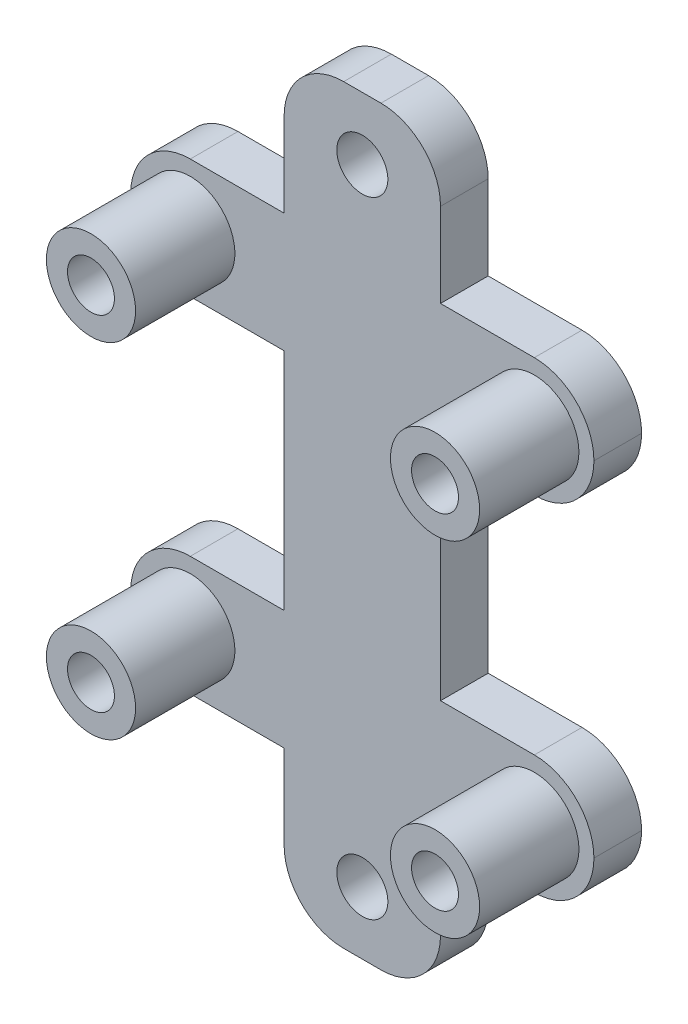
ISO-10303-21;
HEADER;
FILE_DESCRIPTION(('STEP AP214'),'2;1');
FILE_NAME('part.step','',(''),(''),'','','');
FILE_SCHEMA(('AUTOMOTIVE_DESIGN { 1 0 10303 214 1 1 1 1 }'));
ENDSEC;
DATA;
#1=APPLICATION_CONTEXT('core data for automotive mechanical design processes');
#2=APPLICATION_PROTOCOL_DEFINITION('international standard','automotive_design',2000,#1);
#3=PRODUCT_CONTEXT('',#1,'mechanical');
#4=PRODUCT('Part','Part','',(#3));
#5=PRODUCT_RELATED_PRODUCT_CATEGORY('part','',(#4));
#6=PRODUCT_DEFINITION_FORMATION('','',#4);
#7=PRODUCT_DEFINITION_CONTEXT('part definition',#1,'design');
#8=PRODUCT_DEFINITION('design','',#6,#7);
#9=PRODUCT_DEFINITION_SHAPE('','',#8);
#10=(LENGTH_UNIT() NAMED_UNIT(*) SI_UNIT(.MILLI.,.METRE.));
#11=(NAMED_UNIT(*) PLANE_ANGLE_UNIT() SI_UNIT($,.RADIAN.));
#12=(NAMED_UNIT(*) SI_UNIT($,.STERADIAN.) SOLID_ANGLE_UNIT());
#13=UNCERTAINTY_MEASURE_WITH_UNIT(LENGTH_MEASURE(1.E-05),#10,'distance_accuracy_value','');
#14=(GEOMETRIC_REPRESENTATION_CONTEXT(3) GLOBAL_UNCERTAINTY_ASSIGNED_CONTEXT((#13)) GLOBAL_UNIT_ASSIGNED_CONTEXT((#10,
#11,#12)) REPRESENTATION_CONTEXT('',''));
#15=CARTESIAN_POINT('',(0.,0.,0.));
#16=DIRECTION('',(0.,0.,1.));
#17=DIRECTION('',(1.,0.,0.));
#18=AXIS2_PLACEMENT_3D('',#15,#16,#17);
#19=CARTESIAN_POINT('',(16.000015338,-4.34331143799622,3.048));
#20=DIRECTION('',(0.,0.,1.));
#21=DIRECTION('',(1.,0.,0.));
#22=AXIS2_PLACEMENT_3D('',#19,#20,#21);
#23=CYLINDRICAL_SURFACE('',#22,3.81);
#24=DIRECTION('',(0.,0.,1.));
#25=VECTOR('',#24,1.);
#26=CARTESIAN_POINT('',(16.000015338,-8.15331143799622,3.048));
#27=LINE('',#26,#25);
#28=CARTESIAN_POINT('',(16.000015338,-8.15331143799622,0.));
#29=VERTEX_POINT('',#28);
#30=CARTESIAN_POINT('',(16.000015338,-8.15331143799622,3.048));
#31=VERTEX_POINT('',#30);
#32=EDGE_CURVE('E554',#29,#31,#27,.T.);
#33=ORIENTED_EDGE('',*,*,#32,.F.);
#34=CARTESIAN_POINT('',(16.000015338,-4.34331143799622,0.));
#35=DIRECTION('',(0.,0.,-1.));
#36=DIRECTION('',(-1.,0.,0.));
#37=AXIS2_PLACEMENT_3D('',#34,#35,#36);
#38=CIRCLE('',#37,3.81);
#39=CARTESIAN_POINT('',(19.810015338,-4.34331143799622,0.));
#40=VERTEX_POINT('',#39);
#41=EDGE_CURVE('E53',#40,#29,#38,.T.);
#42=ORIENTED_EDGE('',*,*,#41,.F.);
#43=DIRECTION('',(0.,0.,1.));
#44=VECTOR('',#43,1.);
#45=CARTESIAN_POINT('',(19.810015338,-4.34331143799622,3.048));
#46=LINE('',#45,#44);
#47=CARTESIAN_POINT('',(19.810015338,-4.34331143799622,3.048));
#48=VERTEX_POINT('',#47);
#49=EDGE_CURVE('E558',#48,#40,#46,.F.);
#50=ORIENTED_EDGE('',*,*,#49,.F.);
#51=CARTESIAN_POINT('',(16.000015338,-4.34331143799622,3.048));
#52=DIRECTION('',(0.,0.,-1.));
#53=DIRECTION('',(-1.,0.,0.));
#54=AXIS2_PLACEMENT_3D('',#51,#52,#53);
#55=CIRCLE('',#54,3.81);
#56=EDGE_CURVE('E11',#31,#48,#55,.F.);
#57=ORIENTED_EDGE('',*,*,#56,.F.);
#58=EDGE_LOOP('',(#33,#42,#50,#57));
#59=FACE_BOUND('',#58,.T.);
#60=ADVANCED_FACE('F45',(#59),#23,.T.);
#61=CARTESIAN_POINT('',(13.620015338,-4.34331143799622,3.048));
#62=DIRECTION('',(0.,0.,1.));
#63=DIRECTION('',(1.,0.,0.));
#64=AXIS2_PLACEMENT_3D('',#61,#62,#63);
#65=CYLINDRICAL_SURFACE('',#64,3.81);
#66=DIRECTION('',(0.,0.,1.));
#67=VECTOR('',#66,1.);
#68=CARTESIAN_POINT('',(9.81001533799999,-4.34331143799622,3.048));
#69=LINE('',#68,#67);
#70=CARTESIAN_POINT('',(9.81001533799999,-4.34331143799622,0.));
#71=VERTEX_POINT('',#70);
#72=CARTESIAN_POINT('',(9.81001533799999,-4.34331143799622,3.048));
#73=VERTEX_POINT('',#72);
#74=EDGE_CURVE('E539',#71,#73,#69,.T.);
#75=ORIENTED_EDGE('',*,*,#74,.F.);
#76=CARTESIAN_POINT('',(13.620015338,-4.34331143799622,0.));
#77=DIRECTION('',(0.,0.,-1.));
#78=DIRECTION('',(-1.,0.,0.));
#79=AXIS2_PLACEMENT_3D('',#76,#77,#78);
#80=CIRCLE('',#79,3.81);
#81=CARTESIAN_POINT('',(13.620015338,-8.15331143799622,0.));
#82=VERTEX_POINT('',#81);
#83=EDGE_CURVE('E547',#82,#71,#80,.T.);
#84=ORIENTED_EDGE('',*,*,#83,.F.);
#85=DIRECTION('',(0.,0.,1.));
#86=VECTOR('',#85,1.);
#87=CARTESIAN_POINT('',(13.620015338,-8.15331143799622,3.048));
#88=LINE('',#87,#86);
#89=CARTESIAN_POINT('',(13.620015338,-8.15331143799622,3.048));
#90=VERTEX_POINT('',#89);
#91=EDGE_CURVE('E543',#90,#82,#88,.F.);
#92=ORIENTED_EDGE('',*,*,#91,.F.);
#93=CARTESIAN_POINT('',(13.620015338,-4.34331143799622,3.048));
#94=DIRECTION('',(0.,0.,-1.));
#95=DIRECTION('',(-1.,0.,0.));
#96=AXIS2_PLACEMENT_3D('',#93,#94,#95);
#97=CIRCLE('',#96,3.81);
#98=EDGE_CURVE('E550',#73,#90,#97,.F.);
#99=ORIENTED_EDGE('',*,*,#98,.F.);
#100=EDGE_LOOP('',(#75,#84,#92,#99));
#101=FACE_BOUND('',#100,.T.);
#102=ADVANCED_FACE('F571',(#101),#65,.T.);
#103=CARTESIAN_POINT('',(16.000015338,36.0366885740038,3.048));
#104=DIRECTION('',(0.,0.,-1.));
#105=DIRECTION('',(-1.,0.,0.));
#106=AXIS2_PLACEMENT_3D('',#103,#104,#105);
#107=CYLINDRICAL_SURFACE('',#106,3.81);
#108=DIRECTION('',(0.,0.,-1.));
#109=VECTOR('',#108,1.);
#110=CARTESIAN_POINT('',(16.000015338,39.8466885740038,3.048));
#111=LINE('',#110,#109);
#112=CARTESIAN_POINT('',(16.000015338,39.8466885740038,3.048));
#113=VERTEX_POINT('',#112);
#114=CARTESIAN_POINT('',(16.000015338,39.8466885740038,0.));
#115=VERTEX_POINT('',#114);
#116=EDGE_CURVE('E525',#113,#115,#111,.T.);
#117=ORIENTED_EDGE('',*,*,#116,.F.);
#118=CARTESIAN_POINT('',(16.000015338,36.0366885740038,3.048));
#119=DIRECTION('',(0.,0.,-1.));
#120=DIRECTION('',(-1.,0.,0.));
#121=AXIS2_PLACEMENT_3D('',#118,#119,#120);
#122=CIRCLE('',#121,3.81);
#123=CARTESIAN_POINT('',(19.810015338,36.0366885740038,3.048));
#124=VERTEX_POINT('',#123);
#125=EDGE_CURVE('E533',#124,#113,#122,.F.);
#126=ORIENTED_EDGE('',*,*,#125,.F.);
#127=DIRECTION('',(0.,0.,-1.));
#128=VECTOR('',#127,1.);
#129=CARTESIAN_POINT('',(19.810015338,36.0366885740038,3.048));
#130=LINE('',#129,#128);
#131=CARTESIAN_POINT('',(19.810015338,36.0366885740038,0.));
#132=VERTEX_POINT('',#131);
#133=EDGE_CURVE('E529',#132,#124,#130,.F.);
#134=ORIENTED_EDGE('',*,*,#133,.F.);
#135=CARTESIAN_POINT('',(16.000015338,36.0366885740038,0.));
#136=DIRECTION('',(0.,0.,-1.));
#137=DIRECTION('',(-1.,0.,0.));
#138=AXIS2_PLACEMENT_3D('',#135,#136,#137);
#139=CIRCLE('',#138,3.81);
#140=EDGE_CURVE('E536',#115,#132,#139,.T.);
#141=ORIENTED_EDGE('',*,*,#140,.F.);
#142=EDGE_LOOP('',(#117,#126,#134,#141));
#143=FACE_BOUND('',#142,.T.);
#144=ADVANCED_FACE('F634',(#143),#107,.T.);
#145=CARTESIAN_POINT('',(13.620015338,36.0366885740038,3.048));
#146=DIRECTION('',(0.,0.,-1.));
#147=DIRECTION('',(-1.,0.,0.));
#148=AXIS2_PLACEMENT_3D('',#145,#146,#147);
#149=CYLINDRICAL_SURFACE('',#148,3.81);
#150=DIRECTION('',(0.,0.,-1.));
#151=VECTOR('',#150,1.);
#152=CARTESIAN_POINT('',(9.81001533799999,36.0366885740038,3.048));
#153=LINE('',#152,#151);
#154=CARTESIAN_POINT('',(9.81001533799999,36.0366885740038,3.048));
#155=VERTEX_POINT('',#154);
#156=CARTESIAN_POINT('',(9.81001533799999,36.0366885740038,0.));
#157=VERTEX_POINT('',#156);
#158=EDGE_CURVE('E510',#155,#157,#153,.T.);
#159=ORIENTED_EDGE('',*,*,#158,.F.);
#160=CARTESIAN_POINT('',(13.620015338,36.0366885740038,3.048));
#161=DIRECTION('',(0.,0.,-1.));
#162=DIRECTION('',(-1.,0.,0.));
#163=AXIS2_PLACEMENT_3D('',#160,#161,#162);
#164=CIRCLE('',#163,3.81);
#165=CARTESIAN_POINT('',(13.620015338,39.8466885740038,3.048));
#166=VERTEX_POINT('',#165);
#167=EDGE_CURVE('E518',#166,#155,#164,.F.);
#168=ORIENTED_EDGE('',*,*,#167,.F.);
#169=DIRECTION('',(0.,0.,-1.));
#170=VECTOR('',#169,1.);
#171=CARTESIAN_POINT('',(13.620015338,39.8466885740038,3.048));
#172=LINE('',#171,#170);
#173=CARTESIAN_POINT('',(13.620015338,39.8466885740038,0.));
#174=VERTEX_POINT('',#173);
#175=EDGE_CURVE('E514',#174,#166,#172,.F.);
#176=ORIENTED_EDGE('',*,*,#175,.F.);
#177=CARTESIAN_POINT('',(13.620015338,36.0366885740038,0.));
#178=DIRECTION('',(0.,0.,-1.));
#179=DIRECTION('',(-1.,0.,0.));
#180=AXIS2_PLACEMENT_3D('',#177,#178,#179);
#181=CIRCLE('',#180,3.81);
#182=EDGE_CURVE('E521',#157,#174,#181,.T.);
#183=ORIENTED_EDGE('',*,*,#182,.F.);
#184=EDGE_LOOP('',(#159,#168,#176,#183));
#185=FACE_BOUND('',#184,.T.);
#186=ADVANCED_FACE('F625',(#185),#149,.T.);
#187=CARTESIAN_POINT('',(25.810030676,4.84667323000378,3.048));
#188=DIRECTION('',(0.,0.,-1.));
#189=DIRECTION('',(-1.,0.,0.));
#190=AXIS2_PLACEMENT_3D('',#187,#188,#189);
#191=CYLINDRICAL_SURFACE('',#190,3.81);
#192=DIRECTION('',(0.,0.,-1.));
#193=VECTOR('',#192,1.);
#194=CARTESIAN_POINT('',(29.620030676,4.84667323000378,3.048));
#195=LINE('',#194,#193);
#196=CARTESIAN_POINT('',(29.620030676,4.84667323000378,0.));
#197=VERTEX_POINT('',#196);
#198=CARTESIAN_POINT('',(29.620030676,4.84667323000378,3.048));
#199=VERTEX_POINT('',#198);
#200=EDGE_CURVE('E491',#197,#199,#195,.F.);
#201=ORIENTED_EDGE('',*,*,#200,.T.);
#202=CARTESIAN_POINT('',(25.810030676,4.84667323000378,3.048));
#203=DIRECTION('',(0.,0.,-1.));
#204=DIRECTION('',(-1.,0.,0.));
#205=AXIS2_PLACEMENT_3D('',#202,#203,#204);
#206=CIRCLE('',#205,3.81);
#207=CARTESIAN_POINT('',(25.810030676,1.03667323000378,3.048));
#208=VERTEX_POINT('',#207);
#209=EDGE_CURVE('E504',#208,#199,#206,.F.);
#210=ORIENTED_EDGE('',*,*,#209,.F.);
#211=DIRECTION('',(0.,0.,-1.));
#212=VECTOR('',#211,1.);
#213=CARTESIAN_POINT('',(25.810030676,1.03667323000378,3.048));
#214=LINE('',#213,#212);
#215=CARTESIAN_POINT('',(25.810030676,1.03667323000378,0.));
#216=VERTEX_POINT('',#215);
#217=EDGE_CURVE('E236',#216,#208,#214,.F.);
#218=ORIENTED_EDGE('',*,*,#217,.F.);
#219=CARTESIAN_POINT('',(25.810030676,4.84667323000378,0.));
#220=DIRECTION('',(0.,0.,-1.));
#221=DIRECTION('',(-1.,0.,0.));
#222=AXIS2_PLACEMENT_3D('',#219,#220,#221);
#223=CIRCLE('',#222,3.81);
#224=EDGE_CURVE('E507',#197,#216,#223,.T.);
#225=ORIENTED_EDGE('',*,*,#224,.F.);
#226=EDGE_LOOP('',(#201,#210,#218,#225));
#227=FACE_BOUND('',#226,.T.);
#228=ADVANCED_FACE('F668',(#227),#191,.T.);
#229=CARTESIAN_POINT('',(25.810030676,4.84667323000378,3.048));
#230=DIRECTION('',(0.,0.,-1.));
#231=DIRECTION('',(-1.,0.,0.));
#232=AXIS2_PLACEMENT_3D('',#229,#230,#231);
#233=CYLINDRICAL_SURFACE('',#232,3.81);
#234=DIRECTION('',(0.,0.,-1.));
#235=VECTOR('',#234,1.);
#236=CARTESIAN_POINT('',(25.810030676,8.65667323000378,3.048));
#237=LINE('',#236,#235);
#238=CARTESIAN_POINT('',(25.810030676,8.65667323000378,3.048));
#239=VERTEX_POINT('',#238);
#240=CARTESIAN_POINT('',(25.810030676,8.65667323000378,0.));
#241=VERTEX_POINT('',#240);
#242=EDGE_CURVE('E487',#239,#241,#237,.T.);
#243=ORIENTED_EDGE('',*,*,#242,.F.);
#244=CARTESIAN_POINT('',(25.810030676,4.84667323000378,3.048));
#245=DIRECTION('',(0.,0.,-1.));
#246=DIRECTION('',(-1.,0.,0.));
#247=AXIS2_PLACEMENT_3D('',#244,#245,#246);
#248=CIRCLE('',#247,3.81);
#249=EDGE_CURVE('E495',#199,#239,#248,.F.);
#250=ORIENTED_EDGE('',*,*,#249,.F.);
#251=ORIENTED_EDGE('',*,*,#200,.F.);
#252=CARTESIAN_POINT('',(25.810030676,4.84667323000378,0.));
#253=DIRECTION('',(0.,0.,-1.));
#254=DIRECTION('',(-1.,0.,0.));
#255=AXIS2_PLACEMENT_3D('',#252,#253,#254);
#256=CIRCLE('',#255,3.81);
#257=EDGE_CURVE('E498',#241,#197,#256,.T.);
#258=ORIENTED_EDGE('',*,*,#257,.F.);
#259=EDGE_LOOP('',(#243,#250,#251,#258));
#260=FACE_BOUND('',#259,.T.);
#261=ADVANCED_FACE('F665',(#260),#233,.T.);
#262=CARTESIAN_POINT('',(25.810030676,26.8467039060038,3.048));
#263=DIRECTION('',(0.,0.,-1.));
#264=DIRECTION('',(-1.,0.,0.));
#265=AXIS2_PLACEMENT_3D('',#262,#263,#264);
#266=CYLINDRICAL_SURFACE('',#265,3.81);
#267=DIRECTION('',(0.,0.,-1.));
#268=VECTOR('',#267,1.);
#269=CARTESIAN_POINT('',(29.620030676,26.8467039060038,3.048));
#270=LINE('',#269,#268);
#271=CARTESIAN_POINT('',(29.620030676,26.8467039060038,0.));
#272=VERTEX_POINT('',#271);
#273=CARTESIAN_POINT('',(29.620030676,26.8467039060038,3.048));
#274=VERTEX_POINT('',#273);
#275=EDGE_CURVE('E466',#272,#274,#270,.F.);
#276=ORIENTED_EDGE('',*,*,#275,.T.);
#277=CARTESIAN_POINT('',(25.810030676,26.8467039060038,3.048));
#278=DIRECTION('',(0.,0.,-1.));
#279=DIRECTION('',(-1.,0.,0.));
#280=AXIS2_PLACEMENT_3D('',#277,#278,#279);
#281=CIRCLE('',#280,3.81);
#282=CARTESIAN_POINT('',(25.810030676,23.0367039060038,3.048));
#283=VERTEX_POINT('',#282);
#284=EDGE_CURVE('E481',#283,#274,#281,.F.);
#285=ORIENTED_EDGE('',*,*,#284,.F.);
#286=DIRECTION('',(0.,0.,-1.));
#287=VECTOR('',#286,1.);
#288=CARTESIAN_POINT('',(25.810030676,23.0367039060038,3.048));
#289=LINE('',#288,#287);
#290=CARTESIAN_POINT('',(25.810030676,23.0367039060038,0.));
#291=VERTEX_POINT('',#290);
#292=EDGE_CURVE('E477',#291,#283,#289,.F.);
#293=ORIENTED_EDGE('',*,*,#292,.F.);
#294=CARTESIAN_POINT('',(25.810030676,26.8467039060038,0.));
#295=DIRECTION('',(0.,0.,-1.));
#296=DIRECTION('',(-1.,0.,0.));
#297=AXIS2_PLACEMENT_3D('',#294,#295,#296);
#298=CIRCLE('',#297,3.81);
#299=EDGE_CURVE('E484',#272,#291,#298,.T.);
#300=ORIENTED_EDGE('',*,*,#299,.F.);
#301=EDGE_LOOP('',(#276,#285,#293,#300));
#302=FACE_BOUND('',#301,.T.);
#303=ADVANCED_FACE('F650',(#302),#266,.T.);
#304=CARTESIAN_POINT('',(25.810030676,26.8467039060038,3.048));
#305=DIRECTION('',(0.,0.,-1.));
#306=DIRECTION('',(-1.,0.,0.));
#307=AXIS2_PLACEMENT_3D('',#304,#305,#306);
#308=CYLINDRICAL_SURFACE('',#307,3.81);
#309=DIRECTION('',(0.,0.,-1.));
#310=VECTOR('',#309,1.);
#311=CARTESIAN_POINT('',(25.810030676,30.6567039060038,3.048));
#312=LINE('',#311,#310);
#313=CARTESIAN_POINT('',(25.810030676,30.6567039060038,3.048));
#314=VERTEX_POINT('',#313);
#315=CARTESIAN_POINT('',(25.810030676,30.6567039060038,0.));
#316=VERTEX_POINT('',#315);
#317=EDGE_CURVE('E462',#314,#316,#312,.T.);
#318=ORIENTED_EDGE('',*,*,#317,.F.);
#319=CARTESIAN_POINT('',(25.810030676,26.8467039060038,3.048));
#320=DIRECTION('',(0.,0.,-1.));
#321=DIRECTION('',(-1.,0.,0.));
#322=AXIS2_PLACEMENT_3D('',#319,#320,#321);
#323=CIRCLE('',#322,3.81);
#324=EDGE_CURVE('E470',#274,#314,#323,.F.);
#325=ORIENTED_EDGE('',*,*,#324,.F.);
#326=ORIENTED_EDGE('',*,*,#275,.F.);
#327=CARTESIAN_POINT('',(25.810030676,26.8467039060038,0.));
#328=DIRECTION('',(0.,0.,-1.));
#329=DIRECTION('',(-1.,0.,0.));
#330=AXIS2_PLACEMENT_3D('',#327,#328,#329);
#331=CIRCLE('',#330,3.81);
#332=EDGE_CURVE('E473',#316,#272,#331,.T.);
#333=ORIENTED_EDGE('',*,*,#332,.F.);
#334=EDGE_LOOP('',(#318,#325,#326,#333));
#335=FACE_BOUND('',#334,.T.);
#336=ADVANCED_FACE('F648',(#335),#308,.T.);
#337=CARTESIAN_POINT('',(3.80999999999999,4.84667323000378,3.048));
#338=DIRECTION('',(0.,0.,1.));
#339=DIRECTION('',(1.,0.,0.));
#340=AXIS2_PLACEMENT_3D('',#337,#338,#339);
#341=CYLINDRICAL_SURFACE('',#340,3.81);
#342=DIRECTION('',(0.,0.,1.));
#343=VECTOR('',#342,1.);
#344=CARTESIAN_POINT('',(0.,4.84667323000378,3.048));
#345=LINE('',#344,#343);
#346=CARTESIAN_POINT('',(0.,4.84667323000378,3.048));
#347=VERTEX_POINT('',#346);
#348=CARTESIAN_POINT('',(0.,4.84667323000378,0.));
#349=VERTEX_POINT('',#348);
#350=EDGE_CURVE('E441',#347,#349,#345,.F.);
#351=ORIENTED_EDGE('',*,*,#350,.T.);
#352=CARTESIAN_POINT('',(3.80999999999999,4.84667323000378,0.));
#353=DIRECTION('',(0.,0.,-1.));
#354=DIRECTION('',(-1.,0.,0.));
#355=AXIS2_PLACEMENT_3D('',#352,#353,#354);
#356=CIRCLE('',#355,3.81);
#357=CARTESIAN_POINT('',(3.81,1.03667323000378,0.));
#358=VERTEX_POINT('',#357);
#359=EDGE_CURVE('E456',#358,#349,#356,.T.);
#360=ORIENTED_EDGE('',*,*,#359,.F.);
#361=DIRECTION('',(0.,0.,1.));
#362=VECTOR('',#361,1.);
#363=CARTESIAN_POINT('',(3.81,1.03667323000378,3.048));
#364=LINE('',#363,#362);
#365=CARTESIAN_POINT('',(3.81,1.03667323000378,3.048));
#366=VERTEX_POINT('',#365);
#367=EDGE_CURVE('E452',#366,#358,#364,.F.);
#368=ORIENTED_EDGE('',*,*,#367,.F.);
#369=CARTESIAN_POINT('',(3.80999999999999,4.84667323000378,3.048));
#370=DIRECTION('',(0.,0.,-1.));
#371=DIRECTION('',(-1.,0.,0.));
#372=AXIS2_PLACEMENT_3D('',#369,#370,#371);
#373=CIRCLE('',#372,3.81);
#374=EDGE_CURVE('E459',#347,#366,#373,.F.);
#375=ORIENTED_EDGE('',*,*,#374,.F.);
#376=EDGE_LOOP('',(#351,#360,#368,#375));
#377=FACE_BOUND('',#376,.T.);
#378=ADVANCED_FACE('F583',(#377),#341,.T.);
#379=CARTESIAN_POINT('',(3.80999999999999,4.84667323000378,3.048));
#380=DIRECTION('',(0.,0.,1.));
#381=DIRECTION('',(1.,0.,0.));
#382=AXIS2_PLACEMENT_3D('',#379,#380,#381);
#383=CYLINDRICAL_SURFACE('',#382,3.81);
#384=DIRECTION('',(0.,0.,1.));
#385=VECTOR('',#384,1.);
#386=CARTESIAN_POINT('',(3.80999999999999,8.65667323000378,3.048));
#387=LINE('',#386,#385);
#388=CARTESIAN_POINT('',(3.80999999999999,8.65667323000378,0.));
#389=VERTEX_POINT('',#388);
#390=CARTESIAN_POINT('',(3.80999999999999,8.65667323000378,3.048));
#391=VERTEX_POINT('',#390);
#392=EDGE_CURVE('E437',#389,#391,#387,.T.);
#393=ORIENTED_EDGE('',*,*,#392,.F.);
#394=CARTESIAN_POINT('',(3.80999999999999,4.84667323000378,0.));
#395=DIRECTION('',(0.,0.,-1.));
#396=DIRECTION('',(-1.,0.,0.));
#397=AXIS2_PLACEMENT_3D('',#394,#395,#396);
#398=CIRCLE('',#397,3.81);
#399=EDGE_CURVE('E445',#349,#389,#398,.T.);
#400=ORIENTED_EDGE('',*,*,#399,.F.);
#401=ORIENTED_EDGE('',*,*,#350,.F.);
#402=CARTESIAN_POINT('',(3.80999999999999,4.84667323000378,3.048));
#403=DIRECTION('',(0.,0.,-1.));
#404=DIRECTION('',(-1.,0.,0.));
#405=AXIS2_PLACEMENT_3D('',#402,#403,#404);
#406=CIRCLE('',#405,3.81);
#407=EDGE_CURVE('E448',#391,#347,#406,.F.);
#408=ORIENTED_EDGE('',*,*,#407,.F.);
#409=EDGE_LOOP('',(#393,#400,#401,#408));
#410=FACE_BOUND('',#409,.T.);
#411=ADVANCED_FACE('F588',(#410),#383,.T.);
#412=CARTESIAN_POINT('',(3.80999999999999,26.8467039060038,3.048));
#413=DIRECTION('',(0.,0.,1.));
#414=DIRECTION('',(1.,0.,0.));
#415=AXIS2_PLACEMENT_3D('',#412,#413,#414);
#416=CYLINDRICAL_SURFACE('',#415,3.81);
#417=DIRECTION('',(0.,0.,-1.));
#418=VECTOR('',#417,1.);
#419=CARTESIAN_POINT('',(0.,26.8467039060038,3.048));
#420=LINE('',#419,#418);
#421=CARTESIAN_POINT('',(0.,26.8467039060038,3.048));
#422=VERTEX_POINT('',#421);
#423=CARTESIAN_POINT('',(0.,26.8467039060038,0.));
#424=VERTEX_POINT('',#423);
#425=EDGE_CURVE('E412',#422,#424,#420,.T.);
#426=ORIENTED_EDGE('',*,*,#425,.T.);
#427=CARTESIAN_POINT('',(3.80999999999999,26.8467039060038,0.));
#428=DIRECTION('',(0.,0.,-1.));
#429=DIRECTION('',(-1.,0.,0.));
#430=AXIS2_PLACEMENT_3D('',#427,#428,#429);
#431=CIRCLE('',#430,3.81);
#432=CARTESIAN_POINT('',(3.80999999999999,23.0367039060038,0.));
#433=VERTEX_POINT('',#432);
#434=EDGE_CURVE('E431',#433,#424,#431,.T.);
#435=ORIENTED_EDGE('',*,*,#434,.F.);
#436=DIRECTION('',(0.,0.,1.));
#437=VECTOR('',#436,1.);
#438=CARTESIAN_POINT('',(3.80999999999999,23.0367039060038,3.048));
#439=LINE('',#438,#437);
#440=CARTESIAN_POINT('',(3.80999999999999,23.0367039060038,3.048));
#441=VERTEX_POINT('',#440);
#442=EDGE_CURVE('E427',#441,#433,#439,.F.);
#443=ORIENTED_EDGE('',*,*,#442,.F.);
#444=CARTESIAN_POINT('',(3.80999999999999,26.8467039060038,3.048));
#445=DIRECTION('',(0.,0.,-1.));
#446=DIRECTION('',(-1.,0.,0.));
#447=AXIS2_PLACEMENT_3D('',#444,#445,#446);
#448=CIRCLE('',#447,3.81);
#449=EDGE_CURVE('E434',#422,#441,#448,.F.);
#450=ORIENTED_EDGE('',*,*,#449,.F.);
#451=EDGE_LOOP('',(#426,#435,#443,#450));
#452=FACE_BOUND('',#451,.T.);
#453=ADVANCED_FACE('F611',(#452),#416,.T.);
#454=CARTESIAN_POINT('',(3.80999999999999,26.8467039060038,3.048));
#455=DIRECTION('',(0.,0.,-1.));
#456=DIRECTION('',(-1.,0.,0.));
#457=AXIS2_PLACEMENT_3D('',#454,#455,#456);
#458=CYLINDRICAL_SURFACE('',#457,3.81);
#459=ORIENTED_EDGE('',*,*,#425,.F.);
#460=CARTESIAN_POINT('',(3.80999999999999,26.8467039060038,3.048));
#461=DIRECTION('',(0.,0.,-1.));
#462=DIRECTION('',(-1.,0.,0.));
#463=AXIS2_PLACEMENT_3D('',#460,#461,#462);
#464=CIRCLE('',#463,3.81);
#465=CARTESIAN_POINT('',(3.81,30.6567039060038,3.048));
#466=VERTEX_POINT('',#465);
#467=EDGE_CURVE('E420',#466,#422,#464,.F.);
#468=ORIENTED_EDGE('',*,*,#467,.F.);
#469=DIRECTION('',(0.,0.,-1.));
#470=VECTOR('',#469,1.);
#471=CARTESIAN_POINT('',(3.81,30.6567039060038,3.048));
#472=LINE('',#471,#470);
#473=CARTESIAN_POINT('',(3.81,30.6567039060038,0.));
#474=VERTEX_POINT('',#473);
#475=EDGE_CURVE('E416',#474,#466,#472,.F.);
#476=ORIENTED_EDGE('',*,*,#475,.F.);
#477=CARTESIAN_POINT('',(3.80999999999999,26.8467039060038,0.));
#478=DIRECTION('',(0.,0.,-1.));
#479=DIRECTION('',(-1.,0.,0.));
#480=AXIS2_PLACEMENT_3D('',#477,#478,#479);
#481=CIRCLE('',#480,3.81);
#482=EDGE_CURVE('E424',#424,#474,#481,.T.);
#483=ORIENTED_EDGE('',*,*,#482,.F.);
#484=EDGE_LOOP('',(#459,#468,#476,#483));
#485=FACE_BOUND('',#484,.T.);
#486=ADVANCED_FACE('F610',(#485),#458,.T.);
#487=CARTESIAN_POINT('',(0.,0.,3.048));
#488=DIRECTION('',(0.,0.,-1.));
#489=DIRECTION('',(-1.,0.,0.));
#490=AXIS2_PLACEMENT_3D('',#487,#488,#489);
#491=PLANE('',#490);
#492=CARTESIAN_POINT('',(3.81,4.84667323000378,3.048));
#493=DIRECTION('',(0.,0.,-1.));
#494=DIRECTION('',(-1.,0.,0.));
#495=AXIS2_PLACEMENT_3D('',#492,#493,#494);
#496=CIRCLE('',#495,2.850000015);
#497=CARTESIAN_POINT('',(0.959999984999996,4.84667323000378,3.048));
#498=VERTEX_POINT('',#497);
#499=EDGE_CURVE('E407',#498,#498,#496,.F.);
#500=ORIENTED_EDGE('',*,*,#499,.F.);
#501=EDGE_LOOP('',(#500));
#502=FACE_BOUND('',#501,.T.);
#503=CARTESIAN_POINT('',(3.810000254,26.8467039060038,3.048));
#504=DIRECTION('',(0.,0.,-1.));
#505=DIRECTION('',(-1.,0.,0.));
#506=AXIS2_PLACEMENT_3D('',#503,#504,#505);
#507=CIRCLE('',#506,2.850000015);
#508=CARTESIAN_POINT('',(0.960000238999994,26.8467039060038,3.048));
#509=VERTEX_POINT('',#508);
#510=EDGE_CURVE('E399',#509,#509,#507,.F.);
#511=ORIENTED_EDGE('',*,*,#510,.F.);
#512=EDGE_LOOP('',(#511));
#513=FACE_BOUND('',#512,.T.);
#514=DIRECTION('',(-1.,0.,0.));
#515=VECTOR('',#514,1.);
#516=CARTESIAN_POINT('',(19.810015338,-8.15331143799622,3.048));
#517=LINE('',#516,#515);
#518=EDGE_CURVE('E253',#31,#90,#517,.T.);
#519=ORIENTED_EDGE('',*,*,#518,.F.);
#520=ORIENTED_EDGE('',*,*,#56,.T.);
#521=DIRECTION('',(0.,-1.,0.));
#522=VECTOR('',#521,1.);
#523=CARTESIAN_POINT('',(19.810015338,1.03667323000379,3.048));
#524=LINE('',#523,#522);
#525=CARTESIAN_POINT('',(19.810015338,1.03667323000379,3.048));
#526=VERTEX_POINT('',#525);
#527=EDGE_CURVE('E238',#526,#48,#524,.T.);
#528=ORIENTED_EDGE('',*,*,#527,.F.);
#529=DIRECTION('',(-1.,0.,0.));
#530=VECTOR('',#529,1.);
#531=CARTESIAN_POINT('',(29.620030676,1.03667323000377,3.048));
#532=LINE('',#531,#530);
#533=EDGE_CURVE('E229',#208,#526,#532,.T.);
#534=ORIENTED_EDGE('',*,*,#533,.F.);
#535=ORIENTED_EDGE('',*,*,#209,.T.);
#536=ORIENTED_EDGE('',*,*,#249,.T.);
#537=DIRECTION('',(1.,0.,0.));
#538=VECTOR('',#537,1.);
#539=CARTESIAN_POINT('',(29.620030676,8.65667323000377,3.048));
#540=LINE('',#539,#538);
#541=CARTESIAN_POINT('',(19.810015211,8.65667323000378,3.048));
#542=VERTEX_POINT('',#541);
#543=EDGE_CURVE('E269',#542,#239,#540,.T.);
#544=ORIENTED_EDGE('',*,*,#543,.F.);
#545=DIRECTION('',(0.,1.,0.));
#546=VECTOR('',#545,1.);
#547=CARTESIAN_POINT('',(19.810015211,15.8466885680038,3.048));
#548=LINE('',#547,#546);
#549=CARTESIAN_POINT('',(19.810015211,23.0367039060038,3.048));
#550=VERTEX_POINT('',#549);
#551=EDGE_CURVE('E347',#542,#550,#548,.T.);
#552=ORIENTED_EDGE('',*,*,#551,.T.);
#553=DIRECTION('',(1.,0.,0.));
#554=VECTOR('',#553,1.);
#555=CARTESIAN_POINT('',(29.620030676,23.0367039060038,3.048));
#556=LINE('',#555,#554);
#557=EDGE_CURVE('E350',#550,#283,#556,.T.);
#558=ORIENTED_EDGE('',*,*,#557,.T.);
#559=ORIENTED_EDGE('',*,*,#284,.T.);
#560=ORIENTED_EDGE('',*,*,#324,.T.);
#561=DIRECTION('',(-1.,0.,0.));
#562=VECTOR('',#561,1.);
#563=CARTESIAN_POINT('',(29.620030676,30.6567039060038,3.048));
#564=LINE('',#563,#562);
#565=CARTESIAN_POINT('',(19.810015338,30.6567039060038,3.048));
#566=VERTEX_POINT('',#565);
#567=EDGE_CURVE('E322',#314,#566,#564,.T.);
#568=ORIENTED_EDGE('',*,*,#567,.T.);
#569=DIRECTION('',(0.,1.,0.));
#570=VECTOR('',#569,1.);
#571=CARTESIAN_POINT('',(19.810015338,30.6567039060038,3.048));
#572=LINE('',#571,#570);
#573=EDGE_CURVE('E325',#566,#124,#572,.T.);
#574=ORIENTED_EDGE('',*,*,#573,.T.);
#575=ORIENTED_EDGE('',*,*,#125,.T.);
#576=DIRECTION('',(-1.,0.,0.));
#577=VECTOR('',#576,1.);
#578=CARTESIAN_POINT('',(19.810015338,39.8466885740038,3.048));
#579=LINE('',#578,#577);
#580=EDGE_CURVE('E330',#113,#166,#579,.T.);
#581=ORIENTED_EDGE('',*,*,#580,.T.);
#582=ORIENTED_EDGE('',*,*,#167,.T.);
#583=DIRECTION('',(0.,-1.,0.));
#584=VECTOR('',#583,1.);
#585=CARTESIAN_POINT('',(9.81001533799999,39.8466885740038,3.048));
#586=LINE('',#585,#584);
#587=CARTESIAN_POINT('',(9.81001533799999,30.6567039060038,3.048));
#588=VERTEX_POINT('',#587);
#589=EDGE_CURVE('E333',#155,#588,#586,.T.);
#590=ORIENTED_EDGE('',*,*,#589,.T.);
#591=DIRECTION('',(-1.,0.,0.));
#592=VECTOR('',#591,1.);
#593=CARTESIAN_POINT('',(0.,30.6567039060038,3.048));
#594=LINE('',#593,#592);
#595=EDGE_CURVE('E336',#588,#466,#594,.T.);
#596=ORIENTED_EDGE('',*,*,#595,.T.);
#597=ORIENTED_EDGE('',*,*,#467,.T.);
#598=ORIENTED_EDGE('',*,*,#449,.T.);
#599=DIRECTION('',(1.,0.,0.));
#600=VECTOR('',#599,1.);
#601=CARTESIAN_POINT('',(0.,23.0367039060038,3.048));
#602=LINE('',#601,#600);
#603=CARTESIAN_POINT('',(9.81001521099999,23.0367039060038,3.048));
#604=VERTEX_POINT('',#603);
#605=EDGE_CURVE('E340',#441,#604,#602,.T.);
#606=ORIENTED_EDGE('',*,*,#605,.T.);
#607=DIRECTION('',(0.,-1.,0.));
#608=VECTOR('',#607,1.);
#609=CARTESIAN_POINT('',(9.81001521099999,23.0367039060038,3.048));
#610=LINE('',#609,#608);
#611=CARTESIAN_POINT('',(9.81001521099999,8.65667323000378,3.048));
#612=VERTEX_POINT('',#611);
#613=EDGE_CURVE('E343',#604,#612,#610,.T.);
#614=ORIENTED_EDGE('',*,*,#613,.T.);
#615=DIRECTION('',(1.,0.,0.));
#616=VECTOR('',#615,1.);
#617=CARTESIAN_POINT('',(0.,8.65667323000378,3.048));
#618=LINE('',#617,#616);
#619=EDGE_CURVE('E266',#391,#612,#618,.T.);
#620=ORIENTED_EDGE('',*,*,#619,.F.);
#621=ORIENTED_EDGE('',*,*,#407,.T.);
#622=ORIENTED_EDGE('',*,*,#374,.T.);
#623=DIRECTION('',(-1.,0.,0.));
#624=VECTOR('',#623,1.);
#625=CARTESIAN_POINT('',(0.,1.03667323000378,3.048));
#626=LINE('',#625,#624);
#627=CARTESIAN_POINT('',(9.81001533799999,1.03667323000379,3.048));
#628=VERTEX_POINT('',#627);
#629=EDGE_CURVE('E262',#628,#366,#626,.T.);
#630=ORIENTED_EDGE('',*,*,#629,.F.);
#631=DIRECTION('',(0.,1.,0.));
#632=VECTOR('',#631,1.);
#633=CARTESIAN_POINT('',(9.81001533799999,-8.15331143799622,3.048));
#634=LINE('',#633,#632);
#635=EDGE_CURVE('E256',#73,#628,#634,.T.);
#636=ORIENTED_EDGE('',*,*,#635,.F.);
#637=ORIENTED_EDGE('',*,*,#98,.T.);
#638=EDGE_LOOP('',(#519,#520,#528,#534,#535,#536,#544,#552,#558,#559,#560,#568,#574,#575,#581,
#582,#590,#596,#597,#598,#606,#614,#620,#621,#622,#630,#636,#637));
#639=FACE_BOUND('',#638,.T.);
#640=CARTESIAN_POINT('',(14.810015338,35.8466885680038,3.048));
#641=DIRECTION('',(0.,0.,1.));
#642=DIRECTION('',(1.,0.,0.));
#643=AXIS2_PLACEMENT_3D('',#640,#641,#642);
#644=CIRCLE('',#643,1.63195);
#645=CARTESIAN_POINT('',(13.178065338,35.8466885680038,3.048));
#646=VERTEX_POINT('',#645);
#647=EDGE_CURVE('E314',#646,#646,#644,.T.);
#648=ORIENTED_EDGE('',*,*,#647,.F.);
#649=EDGE_LOOP('',(#648));
#650=FACE_BOUND('',#649,.T.);
#651=CARTESIAN_POINT('',(14.810015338,-4.15331143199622,3.048));
#652=DIRECTION('',(0.,0.,-1.));
#653=DIRECTION('',(1.,0.,0.));
#654=AXIS2_PLACEMENT_3D('',#651,#652,#653);
#655=CIRCLE('',#654,1.63195);
#656=CARTESIAN_POINT('',(13.178065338,-4.15331143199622,3.048));
#657=VERTEX_POINT('',#656);
#658=EDGE_CURVE('E277',#657,#657,#655,.T.);
#659=ORIENTED_EDGE('',*,*,#658,.T.);
#660=EDGE_LOOP('',(#659));
#661=FACE_BOUND('',#660,.T.);
#662=CARTESIAN_POINT('',(25.810030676,4.84667323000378,3.048));
#663=DIRECTION('',(0.,0.,-1.));
#664=DIRECTION('',(-1.,0.,0.));
#665=AXIS2_PLACEMENT_3D('',#662,#663,#664);
#666=CIRCLE('',#665,2.850000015);
#667=CARTESIAN_POINT('',(22.960030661,4.84667323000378,3.048));
#668=VERTEX_POINT('',#667);
#669=EDGE_CURVE('E403',#668,#668,#666,.F.);
#670=ORIENTED_EDGE('',*,*,#669,.F.);
#671=EDGE_LOOP('',(#670));
#672=FACE_BOUND('',#671,.T.);
#673=CARTESIAN_POINT('',(25.810030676,26.8467039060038,3.048));
#674=DIRECTION('',(0.,0.,1.));
#675=DIRECTION('',(1.,0.,0.));
#676=AXIS2_PLACEMENT_3D('',#673,#674,#675);
#677=CIRCLE('',#676,2.850000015);
#678=CARTESIAN_POINT('',(28.660030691,26.8467039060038,3.048));
#679=VERTEX_POINT('',#678);
#680=EDGE_CURVE('E411',#679,#679,#677,.T.);
#681=ORIENTED_EDGE('',*,*,#680,.F.);
#682=EDGE_LOOP('',(#681));
#683=FACE_BOUND('',#682,.T.);
#684=ADVANCED_FACE('F250',(#502,#513,#639,#650,#661,#672,#683),#491,.F.);
#685=CARTESIAN_POINT('',(0.,0.,0.));
#686=DIRECTION('',(0.,0.,-1.));
#687=DIRECTION('',(-1.,0.,0.));
#688=AXIS2_PLACEMENT_3D('',#685,#686,#687);
#689=PLANE('',#688);
#690=CARTESIAN_POINT('',(3.81,26.8467039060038,0.));
#691=DIRECTION('',(0.,0.,1.));
#692=DIRECTION('',(1.,0.,0.));
#693=AXIS2_PLACEMENT_3D('',#690,#691,#692);
#694=CIRCLE('',#693,1.499997);
#695=CARTESIAN_POINT('',(2.310003,26.8467039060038,0.));
#696=VERTEX_POINT('',#695);
#697=EDGE_CURVE('E309',#696,#696,#694,.T.);
#698=ORIENTED_EDGE('',*,*,#697,.T.);
#699=EDGE_LOOP('',(#698));
#700=FACE_BOUND('',#699,.T.);
#701=DIRECTION('',(0.,-1.,0.));
#702=VECTOR('',#701,1.);
#703=CARTESIAN_POINT('',(19.810015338,1.03667323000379,0.));
#704=LINE('',#703,#702);
#705=CARTESIAN_POINT('',(19.810015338,1.03667323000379,0.));
#706=VERTEX_POINT('',#705);
#707=EDGE_CURVE('E245',#706,#40,#704,.T.);
#708=ORIENTED_EDGE('',*,*,#707,.T.);
#709=ORIENTED_EDGE('',*,*,#41,.T.);
#710=DIRECTION('',(-1.,0.,0.));
#711=VECTOR('',#710,1.);
#712=CARTESIAN_POINT('',(19.810015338,-8.15331143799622,0.));
#713=LINE('',#712,#711);
#714=EDGE_CURVE('E280',#29,#82,#713,.T.);
#715=ORIENTED_EDGE('',*,*,#714,.T.);
#716=ORIENTED_EDGE('',*,*,#83,.T.);
#717=DIRECTION('',(0.,1.,0.));
#718=VECTOR('',#717,1.);
#719=CARTESIAN_POINT('',(9.81001533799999,-8.15331143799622,0.));
#720=LINE('',#719,#718);
#721=CARTESIAN_POINT('',(9.81001533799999,1.03667323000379,0.));
#722=VERTEX_POINT('',#721);
#723=EDGE_CURVE('E283',#71,#722,#720,.T.);
#724=ORIENTED_EDGE('',*,*,#723,.T.);
#725=DIRECTION('',(-1.,0.,0.));
#726=VECTOR('',#725,1.);
#727=CARTESIAN_POINT('',(0.,1.03667323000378,0.));
#728=LINE('',#727,#726);
#729=EDGE_CURVE('E286',#722,#358,#728,.T.);
#730=ORIENTED_EDGE('',*,*,#729,.T.);
#731=ORIENTED_EDGE('',*,*,#359,.T.);
#732=ORIENTED_EDGE('',*,*,#399,.T.);
#733=DIRECTION('',(1.,0.,0.));
#734=VECTOR('',#733,1.);
#735=CARTESIAN_POINT('',(0.,8.65667323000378,0.));
#736=LINE('',#735,#734);
#737=CARTESIAN_POINT('',(9.81001521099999,8.65667323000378,0.));
#738=VERTEX_POINT('',#737);
#739=EDGE_CURVE('E290',#389,#738,#736,.T.);
#740=ORIENTED_EDGE('',*,*,#739,.T.);
#741=DIRECTION('',(0.,-1.,0.));
#742=VECTOR('',#741,1.);
#743=CARTESIAN_POINT('',(9.81001521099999,23.0367039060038,0.));
#744=LINE('',#743,#742);
#745=CARTESIAN_POINT('',(9.81001521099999,23.0367039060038,0.));
#746=VERTEX_POINT('',#745);
#747=EDGE_CURVE('E374',#746,#738,#744,.T.);
#748=ORIENTED_EDGE('',*,*,#747,.F.);
#749=DIRECTION('',(1.,0.,0.));
#750=VECTOR('',#749,1.);
#751=CARTESIAN_POINT('',(0.,23.0367039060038,0.));
#752=LINE('',#751,#750);
#753=EDGE_CURVE('E371',#433,#746,#752,.T.);
#754=ORIENTED_EDGE('',*,*,#753,.F.);
#755=ORIENTED_EDGE('',*,*,#434,.T.);
#756=ORIENTED_EDGE('',*,*,#482,.T.);
#757=DIRECTION('',(-1.,0.,0.));
#758=VECTOR('',#757,1.);
#759=CARTESIAN_POINT('',(0.,30.6567039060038,0.));
#760=LINE('',#759,#758);
#761=CARTESIAN_POINT('',(9.81001533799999,30.6567039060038,0.));
#762=VERTEX_POINT('',#761);
#763=EDGE_CURVE('E367',#762,#474,#760,.T.);
#764=ORIENTED_EDGE('',*,*,#763,.F.);
#765=DIRECTION('',(0.,-1.,0.));
#766=VECTOR('',#765,1.);
#767=CARTESIAN_POINT('',(9.81001533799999,39.8466885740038,0.));
#768=LINE('',#767,#766);
#769=EDGE_CURVE('E364',#157,#762,#768,.T.);
#770=ORIENTED_EDGE('',*,*,#769,.F.);
#771=ORIENTED_EDGE('',*,*,#182,.T.);
#772=DIRECTION('',(-1.,0.,0.));
#773=VECTOR('',#772,1.);
#774=CARTESIAN_POINT('',(19.810015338,39.8466885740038,0.));
#775=LINE('',#774,#773);
#776=EDGE_CURVE('E361',#115,#174,#775,.T.);
#777=ORIENTED_EDGE('',*,*,#776,.F.);
#778=ORIENTED_EDGE('',*,*,#140,.T.);
#779=DIRECTION('',(0.,1.,0.));
#780=VECTOR('',#779,1.);
#781=CARTESIAN_POINT('',(19.810015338,30.6567039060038,0.));
#782=LINE('',#781,#780);
#783=CARTESIAN_POINT('',(19.810015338,30.6567039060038,0.));
#784=VERTEX_POINT('',#783);
#785=EDGE_CURVE('E357',#784,#132,#782,.T.);
#786=ORIENTED_EDGE('',*,*,#785,.F.);
#787=DIRECTION('',(-1.,0.,0.));
#788=VECTOR('',#787,1.);
#789=CARTESIAN_POINT('',(29.620030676,30.6567039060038,0.));
#790=LINE('',#789,#788);
#791=EDGE_CURVE('E318',#316,#784,#790,.T.);
#792=ORIENTED_EDGE('',*,*,#791,.F.);
#793=ORIENTED_EDGE('',*,*,#332,.T.);
#794=ORIENTED_EDGE('',*,*,#299,.T.);
#795=DIRECTION('',(1.,0.,0.));
#796=VECTOR('',#795,1.);
#797=CARTESIAN_POINT('',(29.620030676,23.0367039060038,0.));
#798=LINE('',#797,#796);
#799=CARTESIAN_POINT('',(19.810015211,23.0367039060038,0.));
#800=VERTEX_POINT('',#799);
#801=EDGE_CURVE('E326',#800,#291,#798,.T.);
#802=ORIENTED_EDGE('',*,*,#801,.F.);
#803=DIRECTION('',(0.,1.,0.));
#804=VECTOR('',#803,1.);
#805=CARTESIAN_POINT('',(19.810015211,15.8466885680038,0.));
#806=LINE('',#805,#804);
#807=CARTESIAN_POINT('',(19.810015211,8.65667323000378,0.));
#808=VERTEX_POINT('',#807);
#809=EDGE_CURVE('E378',#808,#800,#806,.T.);
#810=ORIENTED_EDGE('',*,*,#809,.F.);
#811=DIRECTION('',(1.,0.,0.));
#812=VECTOR('',#811,1.);
#813=CARTESIAN_POINT('',(29.620030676,8.65667323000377,0.));
#814=LINE('',#813,#812);
#815=EDGE_CURVE('E239',#808,#241,#814,.T.);
#816=ORIENTED_EDGE('',*,*,#815,.T.);
#817=ORIENTED_EDGE('',*,*,#257,.T.);
#818=ORIENTED_EDGE('',*,*,#224,.T.);
#819=DIRECTION('',(-1.,0.,0.));
#820=VECTOR('',#819,1.);
#821=CARTESIAN_POINT('',(29.620030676,1.03667323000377,0.));
#822=LINE('',#821,#820);
#823=EDGE_CURVE('E274',#216,#706,#822,.T.);
#824=ORIENTED_EDGE('',*,*,#823,.T.);
#825=EDGE_LOOP('',(#708,#709,#715,#716,#724,#730,#731,#732,#740,#748,#754,#755,#756,#764,#770,
#771,#777,#778,#786,#792,#793,#794,#802,#810,#816,#817,#818,#824));
#826=FACE_BOUND('',#825,.T.);
#827=CARTESIAN_POINT('',(14.810015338,35.8466885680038,0.));
#828=DIRECTION('',(0.,0.,1.));
#829=DIRECTION('',(1.,0.,0.));
#830=AXIS2_PLACEMENT_3D('',#827,#828,#829);
#831=CIRCLE('',#830,1.63195);
#832=CARTESIAN_POINT('',(13.178065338,35.8466885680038,0.));
#833=VERTEX_POINT('',#832);
#834=EDGE_CURVE('E313',#833,#833,#831,.T.);
#835=ORIENTED_EDGE('',*,*,#834,.T.);
#836=EDGE_LOOP('',(#835));
#837=FACE_BOUND('',#836,.T.);
#838=CARTESIAN_POINT('',(25.810030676,26.8467039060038,0.));
#839=DIRECTION('',(0.,0.,1.));
#840=DIRECTION('',(1.,0.,0.));
#841=AXIS2_PLACEMENT_3D('',#838,#839,#840);
#842=CIRCLE('',#841,1.499997);
#843=CARTESIAN_POINT('',(24.310033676,26.8467039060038,0.));
#844=VERTEX_POINT('',#843);
#845=EDGE_CURVE('E247',#844,#844,#842,.T.);
#846=ORIENTED_EDGE('',*,*,#845,.T.);
#847=EDGE_LOOP('',(#846));
#848=FACE_BOUND('',#847,.T.);
#849=CARTESIAN_POINT('',(3.81,4.84667323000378,0.));
#850=DIRECTION('',(0.,0.,-1.));
#851=DIRECTION('',(1.,0.,0.));
#852=AXIS2_PLACEMENT_3D('',#849,#850,#851);
#853=CIRCLE('',#852,1.499997);
#854=CARTESIAN_POINT('',(2.310003,4.84667323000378,0.));
#855=VERTEX_POINT('',#854);
#856=EDGE_CURVE('E1099',#855,#855,#853,.T.);
#857=ORIENTED_EDGE('',*,*,#856,.F.);
#858=EDGE_LOOP('',(#857));
#859=FACE_BOUND('',#858,.T.);
#860=CARTESIAN_POINT('',(14.810015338,-4.15331143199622,0.));
#861=DIRECTION('',(0.,0.,-1.));
#862=DIRECTION('',(1.,0.,0.));
#863=AXIS2_PLACEMENT_3D('',#860,#861,#862);
#864=CIRCLE('',#863,1.63195);
#865=CARTESIAN_POINT('',(13.178065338,-4.15331143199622,0.));
#866=VERTEX_POINT('',#865);
#867=EDGE_CURVE('E1103',#866,#866,#864,.T.);
#868=ORIENTED_EDGE('',*,*,#867,.F.);
#869=EDGE_LOOP('',(#868));
#870=FACE_BOUND('',#869,.T.);
#871=CARTESIAN_POINT('',(25.810030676,4.84667323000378,0.));
#872=DIRECTION('',(0.,0.,-1.));
#873=DIRECTION('',(1.,0.,0.));
#874=AXIS2_PLACEMENT_3D('',#871,#872,#873);
#875=CIRCLE('',#874,1.499997);
#876=CARTESIAN_POINT('',(24.310033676,4.84667323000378,0.));
#877=VERTEX_POINT('',#876);
#878=EDGE_CURVE('E1095',#877,#877,#875,.T.);
#879=ORIENTED_EDGE('',*,*,#878,.F.);
#880=EDGE_LOOP('',(#879));
#881=FACE_BOUND('',#880,.T.);
#882=ADVANCED_FACE('F562',(#700,#826,#837,#848,#859,#870,#881),#689,.T.);
#883=CARTESIAN_POINT('',(29.620030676,30.6567039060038,3.048));
#884=DIRECTION('',(0.,-1.,0.));
#885=DIRECTION('',(1.,0.,0.));
#886=AXIS2_PLACEMENT_3D('',#883,#884,#885);
#887=PLANE('',#886);
#888=ORIENTED_EDGE('',*,*,#567,.F.);
#889=ORIENTED_EDGE('',*,*,#317,.T.);
#890=ORIENTED_EDGE('',*,*,#791,.T.);
#891=DIRECTION('',(0.,0.,-1.));
#892=VECTOR('',#891,1.);
#893=CARTESIAN_POINT('',(19.810015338,30.6567039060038,3.048));
#894=LINE('',#893,#892);
#895=EDGE_CURVE('E395',#566,#784,#894,.T.);
#896=ORIENTED_EDGE('',*,*,#895,.F.);
#897=EDGE_LOOP('',(#888,#889,#890,#896));
#898=FACE_BOUND('',#897,.T.);
#899=ADVANCED_FACE('F641',(#898),#887,.F.);
#900=CARTESIAN_POINT('',(19.810015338,30.6567039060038,3.048));
#901=DIRECTION('',(-1.,0.,0.));
#902=DIRECTION('',(0.,0.,1.));
#903=AXIS2_PLACEMENT_3D('',#900,#901,#902);
#904=PLANE('',#903);
#905=ORIENTED_EDGE('',*,*,#785,.T.);
#906=ORIENTED_EDGE('',*,*,#133,.T.);
#907=ORIENTED_EDGE('',*,*,#573,.F.);
#908=ORIENTED_EDGE('',*,*,#895,.T.);
#909=EDGE_LOOP('',(#905,#906,#907,#908));
#910=FACE_BOUND('',#909,.T.);
#911=ADVANCED_FACE('F637',(#910),#904,.F.);
#912=CARTESIAN_POINT('',(19.810015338,39.8466885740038,3.048));
#913=DIRECTION('',(0.,-1.,0.));
#914=DIRECTION('',(0.,0.,-1.));
#915=AXIS2_PLACEMENT_3D('',#912,#913,#914);
#916=PLANE('',#915);
#917=ORIENTED_EDGE('',*,*,#580,.F.);
#918=ORIENTED_EDGE('',*,*,#116,.T.);
#919=ORIENTED_EDGE('',*,*,#776,.T.);
#920=ORIENTED_EDGE('',*,*,#175,.T.);
#921=EDGE_LOOP('',(#917,#918,#919,#920));
#922=FACE_BOUND('',#921,.T.);
#923=ADVANCED_FACE('F628',(#922),#916,.F.);
#924=CARTESIAN_POINT('',(9.81001533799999,39.8466885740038,3.048));
#925=DIRECTION('',(1.,0.,0.));
#926=DIRECTION('',(0.,0.,-1.));
#927=AXIS2_PLACEMENT_3D('',#924,#925,#926);
#928=PLANE('',#927);
#929=ORIENTED_EDGE('',*,*,#589,.F.);
#930=ORIENTED_EDGE('',*,*,#158,.T.);
#931=ORIENTED_EDGE('',*,*,#769,.T.);
#932=DIRECTION('',(0.,0.,-1.));
#933=VECTOR('',#932,1.);
#934=CARTESIAN_POINT('',(9.81001533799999,30.6567039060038,3.048));
#935=LINE('',#934,#933);
#936=EDGE_CURVE('E391',#588,#762,#935,.T.);
#937=ORIENTED_EDGE('',*,*,#936,.F.);
#938=EDGE_LOOP('',(#929,#930,#931,#937));
#939=FACE_BOUND('',#938,.T.);
#940=ADVANCED_FACE('F621',(#939),#928,.F.);
#941=CARTESIAN_POINT('',(0.,30.6567039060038,3.048));
#942=DIRECTION('',(0.,-1.,0.));
#943=DIRECTION('',(1.,0.,0.));
#944=AXIS2_PLACEMENT_3D('',#941,#942,#943);
#945=PLANE('',#944);
#946=ORIENTED_EDGE('',*,*,#763,.T.);
#947=ORIENTED_EDGE('',*,*,#475,.T.);
#948=ORIENTED_EDGE('',*,*,#595,.F.);
#949=ORIENTED_EDGE('',*,*,#936,.T.);
#950=EDGE_LOOP('',(#946,#947,#948,#949));
#951=FACE_BOUND('',#950,.T.);
#952=ADVANCED_FACE('F614',(#951),#945,.F.);
#953=CARTESIAN_POINT('',(0.,23.0367039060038,3.048));
#954=DIRECTION('',(0.,1.,0.));
#955=DIRECTION('',(0.,0.,1.));
#956=AXIS2_PLACEMENT_3D('',#953,#954,#955);
#957=PLANE('',#956);
#958=ORIENTED_EDGE('',*,*,#605,.F.);
#959=ORIENTED_EDGE('',*,*,#442,.T.);
#960=ORIENTED_EDGE('',*,*,#753,.T.);
#961=DIRECTION('',(0.,0.,-1.));
#962=VECTOR('',#961,1.);
#963=CARTESIAN_POINT('',(9.81001521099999,23.0367039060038,3.048));
#964=LINE('',#963,#962);
#965=EDGE_CURVE('E387',#604,#746,#964,.T.);
#966=ORIENTED_EDGE('',*,*,#965,.F.);
#967=EDGE_LOOP('',(#958,#959,#960,#966));
#968=FACE_BOUND('',#967,.T.);
#969=ADVANCED_FACE('F602',(#968),#957,.F.);
#970=CARTESIAN_POINT('',(9.81001521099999,23.0367039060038,3.048));
#971=DIRECTION('',(1.,0.,0.));
#972=DIRECTION('',(0.,1.,0.));
#973=AXIS2_PLACEMENT_3D('',#970,#971,#972);
#974=PLANE('',#973);
#975=ORIENTED_EDGE('',*,*,#747,.T.);
#976=DIRECTION('',(0.,0.,-1.));
#977=VECTOR('',#976,1.);
#978=CARTESIAN_POINT('',(9.81001521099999,8.65667323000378,3.048));
#979=LINE('',#978,#977);
#980=EDGE_CURVE('E299',#612,#738,#979,.T.);
#981=ORIENTED_EDGE('',*,*,#980,.F.);
#982=ORIENTED_EDGE('',*,*,#613,.F.);
#983=ORIENTED_EDGE('',*,*,#965,.T.);
#984=EDGE_LOOP('',(#975,#981,#982,#983));
#985=FACE_BOUND('',#984,.T.);
#986=ADVANCED_FACE('F597',(#985),#974,.F.);
#987=CARTESIAN_POINT('',(19.810015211,15.8466885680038,3.048));
#988=DIRECTION('',(-1.,0.,0.));
#989=DIRECTION('',(0.,0.,1.));
#990=AXIS2_PLACEMENT_3D('',#987,#988,#989);
#991=PLANE('',#990);
#992=ORIENTED_EDGE('',*,*,#809,.T.);
#993=DIRECTION('',(0.,0.,-1.));
#994=VECTOR('',#993,1.);
#995=CARTESIAN_POINT('',(19.810015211,23.0367039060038,3.048));
#996=LINE('',#995,#994);
#997=EDGE_CURVE('E354',#550,#800,#996,.T.);
#998=ORIENTED_EDGE('',*,*,#997,.F.);
#999=ORIENTED_EDGE('',*,*,#551,.F.);
#1000=DIRECTION('',(0.,0.,-1.));
#1001=VECTOR('',#1000,1.);
#1002=CARTESIAN_POINT('',(19.810015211,8.65667323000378,3.048));
#1003=LINE('',#1002,#1001);
#1004=EDGE_CURVE('E273',#542,#808,#1003,.T.);
#1005=ORIENTED_EDGE('',*,*,#1004,.T.);
#1006=EDGE_LOOP('',(#992,#998,#999,#1005));
#1007=FACE_BOUND('',#1006,.T.);
#1008=ADVANCED_FACE('F658',(#1007),#991,.F.);
#1009=CARTESIAN_POINT('',(29.620030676,23.0367039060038,3.048));
#1010=DIRECTION('',(0.,1.,0.));
#1011=DIRECTION('',(-1.,0.,0.));
#1012=AXIS2_PLACEMENT_3D('',#1009,#1010,#1011);
#1013=PLANE('',#1012);
#1014=ORIENTED_EDGE('',*,*,#801,.T.);
#1015=ORIENTED_EDGE('',*,*,#292,.T.);
#1016=ORIENTED_EDGE('',*,*,#557,.F.);
#1017=ORIENTED_EDGE('',*,*,#997,.T.);
#1018=EDGE_LOOP('',(#1014,#1015,#1016,#1017));
#1019=FACE_BOUND('',#1018,.T.);
#1020=ADVANCED_FACE('F653',(#1019),#1013,.F.);
#1021=CARTESIAN_POINT('',(14.810015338,35.8466885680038,3.048));
#1022=DIRECTION('',(0.,0.,-1.));
#1023=DIRECTION('',(-1.,0.,0.));
#1024=AXIS2_PLACEMENT_3D('',#1021,#1022,#1023);
#1025=CYLINDRICAL_SURFACE('',#1024,1.63195);
#1026=CARTESIAN_POINT('',(13.178065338,35.8466885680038,3.048));
#1027=CARTESIAN_POINT('',(13.178065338,35.8466885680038,3.01625));
#1028=CARTESIAN_POINT('',(13.178065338,35.8466885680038,2.9845));
#1029=CARTESIAN_POINT('',(13.178065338,35.8466885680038,2.921));
#1030=CARTESIAN_POINT('',(13.178065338,35.8466885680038,2.88925));
#1031=CARTESIAN_POINT('',(13.178065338,35.8466885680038,2.82575));
#1032=CARTESIAN_POINT('',(13.178065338,35.8466885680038,2.794));
#1033=CARTESIAN_POINT('',(13.178065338,35.8466885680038,2.7305));
#1034=CARTESIAN_POINT('',(13.178065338,35.8466885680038,2.69875));
#1035=CARTESIAN_POINT('',(13.178065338,35.8466885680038,2.63525));
#1036=CARTESIAN_POINT('',(13.178065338,35.8466885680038,2.6035));
#1037=CARTESIAN_POINT('',(13.178065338,35.8466885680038,2.54));
#1038=CARTESIAN_POINT('',(13.178065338,35.8466885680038,2.50825));
#1039=CARTESIAN_POINT('',(13.178065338,35.8466885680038,2.44475));
#1040=CARTESIAN_POINT('',(13.178065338,35.8466885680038,2.413));
#1041=CARTESIAN_POINT('',(13.178065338,35.8466885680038,2.3495));
#1042=CARTESIAN_POINT('',(13.178065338,35.8466885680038,2.31775));
#1043=CARTESIAN_POINT('',(13.178065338,35.8466885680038,2.25425));
#1044=CARTESIAN_POINT('',(13.178065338,35.8466885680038,2.2225));
#1045=CARTESIAN_POINT('',(13.178065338,35.8466885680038,2.159));
#1046=CARTESIAN_POINT('',(13.178065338,35.8466885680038,2.12725));
#1047=CARTESIAN_POINT('',(13.178065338,35.8466885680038,2.06375));
#1048=CARTESIAN_POINT('',(13.178065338,35.8466885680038,2.032));
#1049=CARTESIAN_POINT('',(13.178065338,35.8466885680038,1.9685));
#1050=CARTESIAN_POINT('',(13.178065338,35.8466885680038,1.93675));
#1051=CARTESIAN_POINT('',(13.178065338,35.8466885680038,1.87325));
#1052=CARTESIAN_POINT('',(13.178065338,35.8466885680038,1.8415));
#1053=CARTESIAN_POINT('',(13.178065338,35.8466885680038,1.778));
#1054=CARTESIAN_POINT('',(13.178065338,35.8466885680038,1.74625));
#1055=CARTESIAN_POINT('',(13.178065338,35.8466885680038,1.68275));
#1056=CARTESIAN_POINT('',(13.178065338,35.8466885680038,1.651));
#1057=CARTESIAN_POINT('',(13.178065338,35.8466885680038,1.5875));
#1058=CARTESIAN_POINT('',(13.178065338,35.8466885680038,1.55575));
#1059=CARTESIAN_POINT('',(13.178065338,35.8466885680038,1.49225));
#1060=CARTESIAN_POINT('',(13.178065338,35.8466885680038,1.4605));
#1061=CARTESIAN_POINT('',(13.178065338,35.8466885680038,1.397));
#1062=CARTESIAN_POINT('',(13.178065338,35.8466885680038,1.36525));
#1063=CARTESIAN_POINT('',(13.178065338,35.8466885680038,1.30175));
#1064=CARTESIAN_POINT('',(13.178065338,35.8466885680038,1.27));
#1065=CARTESIAN_POINT('',(13.178065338,35.8466885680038,1.2065));
#1066=CARTESIAN_POINT('',(13.178065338,35.8466885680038,1.17475));
#1067=CARTESIAN_POINT('',(13.178065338,35.8466885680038,1.11125));
#1068=CARTESIAN_POINT('',(13.178065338,35.8466885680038,1.0795));
#1069=CARTESIAN_POINT('',(13.178065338,35.8466885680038,1.016));
#1070=CARTESIAN_POINT('',(13.178065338,35.8466885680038,0.98425));
#1071=CARTESIAN_POINT('',(13.178065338,35.8466885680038,0.92075));
#1072=CARTESIAN_POINT('',(13.178065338,35.8466885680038,0.889));
#1073=CARTESIAN_POINT('',(13.178065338,35.8466885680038,0.8255));
#1074=CARTESIAN_POINT('',(13.178065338,35.8466885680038,0.79375));
#1075=CARTESIAN_POINT('',(13.178065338,35.8466885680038,0.73025));
#1076=CARTESIAN_POINT('',(13.178065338,35.8466885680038,0.6985));
#1077=CARTESIAN_POINT('',(13.178065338,35.8466885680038,0.635));
#1078=CARTESIAN_POINT('',(13.178065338,35.8466885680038,0.60325));
#1079=CARTESIAN_POINT('',(13.178065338,35.8466885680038,0.53975));
#1080=CARTESIAN_POINT('',(13.178065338,35.8466885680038,0.508));
#1081=CARTESIAN_POINT('',(13.178065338,35.8466885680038,0.4445));
#1082=CARTESIAN_POINT('',(13.178065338,35.8466885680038,0.41275));
#1083=CARTESIAN_POINT('',(13.178065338,35.8466885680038,0.34925));
#1084=CARTESIAN_POINT('',(13.178065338,35.8466885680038,0.3175));
#1085=CARTESIAN_POINT('',(13.178065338,35.8466885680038,0.254));
#1086=CARTESIAN_POINT('',(13.178065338,35.8466885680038,0.22225));
#1087=CARTESIAN_POINT('',(13.178065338,35.8466885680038,0.15875));
#1088=CARTESIAN_POINT('',(13.178065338,35.8466885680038,0.127));
#1089=CARTESIAN_POINT('',(13.178065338,35.8466885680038,0.0634999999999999));
#1090=CARTESIAN_POINT('',(13.178065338,35.8466885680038,0.03175));
#1091=CARTESIAN_POINT('',(13.178065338,35.8466885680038,0.));
#1092=B_SPLINE_CURVE_WITH_KNOTS('',3,(#1026,#1027,#1028,#1029,#1030,#1031,#1032,#1033,#1034,
#1035,#1036,#1037,#1038,#1039,#1040,#1041,#1042,#1043,#1044,#1045,#1046,#1047,#1048,#1049,#1050,
#1051,#1052,#1053,#1054,#1055,#1056,#1057,#1058,#1059,#1060,#1061,#1062,#1063,#1064,#1065,#1066,
#1067,#1068,#1069,#1070,#1071,#1072,#1073,#1074,#1075,#1076,#1077,#1078,#1079,#1080,#1081,#1082,
#1083,#1084,#1085,#1086,#1087,#1088,#1089,#1090,#1091),.UNSPECIFIED.,.F.,.F.,(4,2,2,2,2,2,2,2,2,
2,2,2,2,2,2,2,2,2,2,2,2,2,2,2,2,2,2,2,2,2,2,2,4),(0.,0.0952499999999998,0.1905,0.28575,0.381,
0.47625,0.5715,0.66675,0.762,0.85725,0.9525,1.04775,1.143,1.23825,1.3335,1.42875,1.524,1.61925,
1.7145,1.80975,1.905,2.00025,2.0955,2.19075,2.286,2.38125,2.4765,2.57175,2.667,2.76225,2.8575,
2.95275,3.048),.UNSPECIFIED.);
#1093=EDGE_CURVE('BSEAM762',#646,#833,#1092,.T.);
#1094=ORIENTED_EDGE('',*,*,#647,.T.);
#1095=ORIENTED_EDGE('',*,*,#834,.F.);
#1096=ORIENTED_EDGE('',*,*,#1093,.T.);
#1097=ORIENTED_EDGE('',*,*,#1093,.F.);
#1098=EDGE_LOOP('',(#1094,#1096,#1095,#1097));
#1099=FACE_BOUND('',#1098,.T.);
#1100=ADVANCED_FACE('F762',(#1099),#1025,.F.);
#1101=CARTESIAN_POINT('',(3.81,26.8467039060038,3.048));
#1102=DIRECTION('',(0.,0.,-1.));
#1103=DIRECTION('',(-1.,0.,0.));
#1104=AXIS2_PLACEMENT_3D('',#1101,#1102,#1103);
#1105=CYLINDRICAL_SURFACE('',#1104,1.499997);
#1106=CARTESIAN_POINT('',(3.81,26.8467039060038,9.398));
#1107=DIRECTION('',(0.,0.,1.));
#1108=DIRECTION('',(1.,0.,0.));
#1109=AXIS2_PLACEMENT_3D('',#1106,#1107,#1108);
#1110=CIRCLE('',#1109,1.499997);
#1111=CARTESIAN_POINT('',(2.310003,26.8467039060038,9.398));
#1112=VERTEX_POINT('',#1111);
#1113=EDGE_CURVE('E1087',#1112,#1112,#1110,.T.);
#1114=CARTESIAN_POINT('',(2.310003,26.8467039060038,0.));
#1115=CARTESIAN_POINT('',(2.310003,26.8467039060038,0.0978958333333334));
#1116=CARTESIAN_POINT('',(2.310003,26.8467039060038,0.195791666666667));
#1117=CARTESIAN_POINT('',(2.310003,26.8467039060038,0.391583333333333));
#1118=CARTESIAN_POINT('',(2.310003,26.8467039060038,0.489479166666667));
#1119=CARTESIAN_POINT('',(2.310003,26.8467039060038,0.685270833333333));
#1120=CARTESIAN_POINT('',(2.310003,26.8467039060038,0.783166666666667));
#1121=CARTESIAN_POINT('',(2.310003,26.8467039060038,0.978958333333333));
#1122=CARTESIAN_POINT('',(2.310003,26.8467039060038,1.07685416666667));
#1123=CARTESIAN_POINT('',(2.310003,26.8467039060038,1.27264583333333));
#1124=CARTESIAN_POINT('',(2.310003,26.8467039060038,1.37054166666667));
#1125=CARTESIAN_POINT('',(2.310003,26.8467039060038,1.56633333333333));
#1126=CARTESIAN_POINT('',(2.310003,26.8467039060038,1.66422916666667));
#1127=CARTESIAN_POINT('',(2.310003,26.8467039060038,1.86002083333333));
#1128=CARTESIAN_POINT('',(2.310003,26.8467039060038,1.95791666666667));
#1129=CARTESIAN_POINT('',(2.310003,26.8467039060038,2.15370833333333));
#1130=CARTESIAN_POINT('',(2.310003,26.8467039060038,2.25160416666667));
#1131=CARTESIAN_POINT('',(2.310003,26.8467039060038,2.44739583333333));
#1132=CARTESIAN_POINT('',(2.310003,26.8467039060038,2.54529166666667));
#1133=CARTESIAN_POINT('',(2.310003,26.8467039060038,2.74108333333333));
#1134=CARTESIAN_POINT('',(2.310003,26.8467039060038,2.83897916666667));
#1135=CARTESIAN_POINT('',(2.310003,26.8467039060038,3.03477083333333));
#1136=CARTESIAN_POINT('',(2.310003,26.8467039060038,3.13266666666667));
#1137=CARTESIAN_POINT('',(2.310003,26.8467039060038,3.32845833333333));
#1138=CARTESIAN_POINT('',(2.310003,26.8467039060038,3.42635416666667));
#1139=CARTESIAN_POINT('',(2.310003,26.8467039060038,3.62214583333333));
#1140=CARTESIAN_POINT('',(2.310003,26.8467039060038,3.72004166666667));
#1141=CARTESIAN_POINT('',(2.310003,26.8467039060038,3.91583333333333));
#1142=CARTESIAN_POINT('',(2.310003,26.8467039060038,4.01372916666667));
#1143=CARTESIAN_POINT('',(2.310003,26.8467039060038,4.20952083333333));
#1144=CARTESIAN_POINT('',(2.310003,26.8467039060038,4.30741666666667));
#1145=CARTESIAN_POINT('',(2.310003,26.8467039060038,4.50320833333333));
#1146=CARTESIAN_POINT('',(2.310003,26.8467039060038,4.60110416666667));
#1147=CARTESIAN_POINT('',(2.310003,26.8467039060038,4.79689583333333));
#1148=CARTESIAN_POINT('',(2.310003,26.8467039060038,4.89479166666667));
#1149=CARTESIAN_POINT('',(2.310003,26.8467039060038,5.09058333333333));
#1150=CARTESIAN_POINT('',(2.310003,26.8467039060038,5.18847916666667));
#1151=CARTESIAN_POINT('',(2.310003,26.8467039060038,5.38427083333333));
#1152=CARTESIAN_POINT('',(2.310003,26.8467039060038,5.48216666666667));
#1153=CARTESIAN_POINT('',(2.310003,26.8467039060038,5.67795833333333));
#1154=CARTESIAN_POINT('',(2.310003,26.8467039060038,5.77585416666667));
#1155=CARTESIAN_POINT('',(2.310003,26.8467039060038,5.97164583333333));
#1156=CARTESIAN_POINT('',(2.310003,26.8467039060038,6.06954166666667));
#1157=CARTESIAN_POINT('',(2.310003,26.8467039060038,6.26533333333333));
#1158=CARTESIAN_POINT('',(2.310003,26.8467039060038,6.36322916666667));
#1159=CARTESIAN_POINT('',(2.310003,26.8467039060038,6.55902083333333));
#1160=CARTESIAN_POINT('',(2.310003,26.8467039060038,6.65691666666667));
#1161=CARTESIAN_POINT('',(2.310003,26.8467039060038,6.85270833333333));
#1162=CARTESIAN_POINT('',(2.310003,26.8467039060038,6.95060416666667));
#1163=CARTESIAN_POINT('',(2.310003,26.8467039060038,7.14639583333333));
#1164=CARTESIAN_POINT('',(2.310003,26.8467039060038,7.24429166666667));
#1165=CARTESIAN_POINT('',(2.310003,26.8467039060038,7.44008333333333));
#1166=CARTESIAN_POINT('',(2.310003,26.8467039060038,7.53797916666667));
#1167=CARTESIAN_POINT('',(2.310003,26.8467039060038,7.73377083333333));
#1168=CARTESIAN_POINT('',(2.310003,26.8467039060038,7.83166666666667));
#1169=CARTESIAN_POINT('',(2.310003,26.8467039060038,8.02745833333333));
#1170=CARTESIAN_POINT('',(2.310003,26.8467039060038,8.12535416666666));
#1171=CARTESIAN_POINT('',(2.310003,26.8467039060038,8.32114583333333));
#1172=CARTESIAN_POINT('',(2.310003,26.8467039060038,8.41904166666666));
#1173=CARTESIAN_POINT('',(2.310003,26.8467039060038,8.61483333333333));
#1174=CARTESIAN_POINT('',(2.310003,26.8467039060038,8.71272916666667));
#1175=CARTESIAN_POINT('',(2.310003,26.8467039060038,8.90852083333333));
#1176=CARTESIAN_POINT('',(2.310003,26.8467039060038,9.00641666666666));
#1177=CARTESIAN_POINT('',(2.310003,26.8467039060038,9.20220833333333));
#1178=CARTESIAN_POINT('',(2.310003,26.8467039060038,9.30010416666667));
#1179=CARTESIAN_POINT('',(2.310003,26.8467039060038,9.398));
#1180=B_SPLINE_CURVE_WITH_KNOTS('',3,(#1114,#1115,#1116,#1117,#1118,#1119,#1120,#1121,#1122,
#1123,#1124,#1125,#1126,#1127,#1128,#1129,#1130,#1131,#1132,#1133,#1134,#1135,#1136,#1137,#1138,
#1139,#1140,#1141,#1142,#1143,#1144,#1145,#1146,#1147,#1148,#1149,#1150,#1151,#1152,#1153,#1154,
#1155,#1156,#1157,#1158,#1159,#1160,#1161,#1162,#1163,#1164,#1165,#1166,#1167,#1168,#1169,#1170,
#1171,#1172,#1173,#1174,#1175,#1176,#1177,#1178,#1179),.UNSPECIFIED.,.F.,.F.,(4,2,2,2,2,2,2,2,2,
2,2,2,2,2,2,2,2,2,2,2,2,2,2,2,2,2,2,2,2,2,2,2,4),(0.,0.2936875,0.587375,0.8810625,1.17475,
1.4684375,1.762125,2.0558125,2.3495,2.6431875,2.936875,3.2305625,3.52425,3.8179375,4.111625,
4.4053125,4.699,4.9926875,5.286375,5.5800625,5.87375,6.1674375,6.461125,6.7548125,7.0485,
7.3421875,7.635875,7.9295625,8.22325,8.5169375,8.810625,9.1043125,9.398),.UNSPECIFIED.);
#1181=EDGE_CURVE('BSEAM771',#696,#1112,#1180,.T.);
#1182=ORIENTED_EDGE('',*,*,#697,.F.);
#1183=ORIENTED_EDGE('',*,*,#1113,.T.);
#1184=ORIENTED_EDGE('',*,*,#1181,.T.);
#1185=ORIENTED_EDGE('',*,*,#1181,.F.);
#1186=EDGE_LOOP('',(#1182,#1184,#1183,#1185));
#1187=FACE_BOUND('',#1186,.T.);
#1188=ADVANCED_FACE('F771',(#1187),#1105,.F.);
#1189=CARTESIAN_POINT('',(25.810030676,26.8467039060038,3.048));
#1190=DIRECTION('',(0.,0.,-1.));
#1191=DIRECTION('',(-1.,0.,0.));
#1192=AXIS2_PLACEMENT_3D('',#1189,#1190,#1191);
#1193=CYLINDRICAL_SURFACE('',#1192,1.499997);
#1194=CARTESIAN_POINT('',(25.810030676,26.8467039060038,9.398));
#1195=DIRECTION('',(0.,0.,1.));
#1196=DIRECTION('',(1.,0.,0.));
#1197=AXIS2_PLACEMENT_3D('',#1194,#1195,#1196);
#1198=CIRCLE('',#1197,1.499997);
#1199=CARTESIAN_POINT('',(24.310033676,26.8467039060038,9.398));
#1200=VERTEX_POINT('',#1199);
#1201=EDGE_CURVE('E1074',#1200,#1200,#1198,.T.);
#1202=CARTESIAN_POINT('',(24.310033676,26.8467039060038,0.));
#1203=CARTESIAN_POINT('',(24.310033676,26.8467039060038,0.0978958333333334));
#1204=CARTESIAN_POINT('',(24.310033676,26.8467039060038,0.195791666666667));
#1205=CARTESIAN_POINT('',(24.310033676,26.8467039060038,0.391583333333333));
#1206=CARTESIAN_POINT('',(24.310033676,26.8467039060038,0.489479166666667));
#1207=CARTESIAN_POINT('',(24.310033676,26.8467039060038,0.685270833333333));
#1208=CARTESIAN_POINT('',(24.310033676,26.8467039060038,0.783166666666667));
#1209=CARTESIAN_POINT('',(24.310033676,26.8467039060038,0.978958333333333));
#1210=CARTESIAN_POINT('',(24.310033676,26.8467039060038,1.07685416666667));
#1211=CARTESIAN_POINT('',(24.310033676,26.8467039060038,1.27264583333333));
#1212=CARTESIAN_POINT('',(24.310033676,26.8467039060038,1.37054166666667));
#1213=CARTESIAN_POINT('',(24.310033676,26.8467039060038,1.56633333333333));
#1214=CARTESIAN_POINT('',(24.310033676,26.8467039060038,1.66422916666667));
#1215=CARTESIAN_POINT('',(24.310033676,26.8467039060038,1.86002083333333));
#1216=CARTESIAN_POINT('',(24.310033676,26.8467039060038,1.95791666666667));
#1217=CARTESIAN_POINT('',(24.310033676,26.8467039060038,2.15370833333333));
#1218=CARTESIAN_POINT('',(24.310033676,26.8467039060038,2.25160416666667));
#1219=CARTESIAN_POINT('',(24.310033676,26.8467039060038,2.44739583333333));
#1220=CARTESIAN_POINT('',(24.310033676,26.8467039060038,2.54529166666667));
#1221=CARTESIAN_POINT('',(24.310033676,26.8467039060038,2.74108333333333));
#1222=CARTESIAN_POINT('',(24.310033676,26.8467039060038,2.83897916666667));
#1223=CARTESIAN_POINT('',(24.310033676,26.8467039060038,3.03477083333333));
#1224=CARTESIAN_POINT('',(24.310033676,26.8467039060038,3.13266666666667));
#1225=CARTESIAN_POINT('',(24.310033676,26.8467039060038,3.32845833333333));
#1226=CARTESIAN_POINT('',(24.310033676,26.8467039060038,3.42635416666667));
#1227=CARTESIAN_POINT('',(24.310033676,26.8467039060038,3.62214583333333));
#1228=CARTESIAN_POINT('',(24.310033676,26.8467039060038,3.72004166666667));
#1229=CARTESIAN_POINT('',(24.310033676,26.8467039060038,3.91583333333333));
#1230=CARTESIAN_POINT('',(24.310033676,26.8467039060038,4.01372916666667));
#1231=CARTESIAN_POINT('',(24.310033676,26.8467039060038,4.20952083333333));
#1232=CARTESIAN_POINT('',(24.310033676,26.8467039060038,4.30741666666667));
#1233=CARTESIAN_POINT('',(24.310033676,26.8467039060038,4.50320833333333));
#1234=CARTESIAN_POINT('',(24.310033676,26.8467039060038,4.60110416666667));
#1235=CARTESIAN_POINT('',(24.310033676,26.8467039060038,4.79689583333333));
#1236=CARTESIAN_POINT('',(24.310033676,26.8467039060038,4.89479166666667));
#1237=CARTESIAN_POINT('',(24.310033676,26.8467039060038,5.09058333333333));
#1238=CARTESIAN_POINT('',(24.310033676,26.8467039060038,5.18847916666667));
#1239=CARTESIAN_POINT('',(24.310033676,26.8467039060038,5.38427083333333));
#1240=CARTESIAN_POINT('',(24.310033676,26.8467039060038,5.48216666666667));
#1241=CARTESIAN_POINT('',(24.310033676,26.8467039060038,5.67795833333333));
#1242=CARTESIAN_POINT('',(24.310033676,26.8467039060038,5.77585416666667));
#1243=CARTESIAN_POINT('',(24.310033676,26.8467039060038,5.97164583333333));
#1244=CARTESIAN_POINT('',(24.310033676,26.8467039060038,6.06954166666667));
#1245=CARTESIAN_POINT('',(24.310033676,26.8467039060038,6.26533333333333));
#1246=CARTESIAN_POINT('',(24.310033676,26.8467039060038,6.36322916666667));
#1247=CARTESIAN_POINT('',(24.310033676,26.8467039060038,6.55902083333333));
#1248=CARTESIAN_POINT('',(24.310033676,26.8467039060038,6.65691666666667));
#1249=CARTESIAN_POINT('',(24.310033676,26.8467039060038,6.85270833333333));
#1250=CARTESIAN_POINT('',(24.310033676,26.8467039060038,6.95060416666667));
#1251=CARTESIAN_POINT('',(24.310033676,26.8467039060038,7.14639583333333));
#1252=CARTESIAN_POINT('',(24.310033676,26.8467039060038,7.24429166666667));
#1253=CARTESIAN_POINT('',(24.310033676,26.8467039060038,7.44008333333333));
#1254=CARTESIAN_POINT('',(24.310033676,26.8467039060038,7.53797916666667));
#1255=CARTESIAN_POINT('',(24.310033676,26.8467039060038,7.73377083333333));
#1256=CARTESIAN_POINT('',(24.310033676,26.8467039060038,7.83166666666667));
#1257=CARTESIAN_POINT('',(24.310033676,26.8467039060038,8.02745833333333));
#1258=CARTESIAN_POINT('',(24.310033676,26.8467039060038,8.12535416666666));
#1259=CARTESIAN_POINT('',(24.310033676,26.8467039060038,8.32114583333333));
#1260=CARTESIAN_POINT('',(24.310033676,26.8467039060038,8.41904166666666));
#1261=CARTESIAN_POINT('',(24.310033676,26.8467039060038,8.61483333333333));
#1262=CARTESIAN_POINT('',(24.310033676,26.8467039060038,8.71272916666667));
#1263=CARTESIAN_POINT('',(24.310033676,26.8467039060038,8.90852083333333));
#1264=CARTESIAN_POINT('',(24.310033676,26.8467039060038,9.00641666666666));
#1265=CARTESIAN_POINT('',(24.310033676,26.8467039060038,9.20220833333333));
#1266=CARTESIAN_POINT('',(24.310033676,26.8467039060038,9.30010416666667));
#1267=CARTESIAN_POINT('',(24.310033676,26.8467039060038,9.398));
#1268=B_SPLINE_CURVE_WITH_KNOTS('',3,(#1202,#1203,#1204,#1205,#1206,#1207,#1208,#1209,#1210,
#1211,#1212,#1213,#1214,#1215,#1216,#1217,#1218,#1219,#1220,#1221,#1222,#1223,#1224,#1225,#1226,
#1227,#1228,#1229,#1230,#1231,#1232,#1233,#1234,#1235,#1236,#1237,#1238,#1239,#1240,#1241,#1242,
#1243,#1244,#1245,#1246,#1247,#1248,#1249,#1250,#1251,#1252,#1253,#1254,#1255,#1256,#1257,#1258,
#1259,#1260,#1261,#1262,#1263,#1264,#1265,#1266,#1267),.UNSPECIFIED.,.F.,.F.,(4,2,2,2,2,2,2,2,2,
2,2,2,2,2,2,2,2,2,2,2,2,2,2,2,2,2,2,2,2,2,2,2,4),(0.,0.2936875,0.587375,0.8810625,1.17475,
1.4684375,1.762125,2.0558125,2.3495,2.6431875,2.936875,3.2305625,3.52425,3.8179375,4.111625,
4.4053125,4.699,4.9926875,5.286375,5.5800625,5.87375,6.1674375,6.461125,6.7548125,7.0485,
7.3421875,7.635875,7.9295625,8.22325,8.5169375,8.810625,9.1043125,9.398),.UNSPECIFIED.);
#1269=EDGE_CURVE('BSEAM782',#844,#1200,#1268,.T.);
#1270=ORIENTED_EDGE('',*,*,#845,.F.);
#1271=ORIENTED_EDGE('',*,*,#1201,.T.);
#1272=ORIENTED_EDGE('',*,*,#1269,.T.);
#1273=ORIENTED_EDGE('',*,*,#1269,.F.);
#1274=EDGE_LOOP('',(#1270,#1272,#1271,#1273));
#1275=FACE_BOUND('',#1274,.T.);
#1276=ADVANCED_FACE('F782',(#1275),#1193,.F.);
#1277=CARTESIAN_POINT('',(29.620030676,1.03667323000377,3.048));
#1278=DIRECTION('',(0.,1.,0.));
#1279=DIRECTION('',(1.,0.,0.));
#1280=AXIS2_PLACEMENT_3D('',#1277,#1278,#1279);
#1281=PLANE('',#1280);
#1282=ORIENTED_EDGE('',*,*,#823,.F.);
#1283=ORIENTED_EDGE('',*,*,#217,.T.);
#1284=ORIENTED_EDGE('',*,*,#533,.T.);
#1285=DIRECTION('',(0.,0.,-1.));
#1286=VECTOR('',#1285,1.);
#1287=CARTESIAN_POINT('',(19.810015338,1.03667323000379,3.048));
#1288=LINE('',#1287,#1286);
#1289=EDGE_CURVE('E233',#526,#706,#1288,.T.);
#1290=ORIENTED_EDGE('',*,*,#1289,.T.);
#1291=EDGE_LOOP('',(#1282,#1283,#1284,#1290));
#1292=FACE_BOUND('',#1291,.T.);
#1293=ADVANCED_FACE('F232',(#1292),#1281,.F.);
#1294=CARTESIAN_POINT('',(19.810015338,1.03667323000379,3.048));
#1295=DIRECTION('',(-1.,0.,0.));
#1296=DIRECTION('',(0.,0.,1.));
#1297=AXIS2_PLACEMENT_3D('',#1294,#1295,#1296);
#1298=PLANE('',#1297);
#1299=ORIENTED_EDGE('',*,*,#527,.T.);
#1300=ORIENTED_EDGE('',*,*,#49,.T.);
#1301=ORIENTED_EDGE('',*,*,#707,.F.);
#1302=ORIENTED_EDGE('',*,*,#1289,.F.);
#1303=EDGE_LOOP('',(#1299,#1300,#1301,#1302));
#1304=FACE_BOUND('',#1303,.T.);
#1305=ADVANCED_FACE('F243',(#1304),#1298,.F.);
#1306=CARTESIAN_POINT('',(19.810015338,-8.15331143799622,3.048));
#1307=DIRECTION('',(0.,1.,0.));
#1308=DIRECTION('',(0.,0.,-1.));
#1309=AXIS2_PLACEMENT_3D('',#1306,#1307,#1308);
#1310=PLANE('',#1309);
#1311=ORIENTED_EDGE('',*,*,#714,.F.);
#1312=ORIENTED_EDGE('',*,*,#32,.T.);
#1313=ORIENTED_EDGE('',*,*,#518,.T.);
#1314=ORIENTED_EDGE('',*,*,#91,.T.);
#1315=EDGE_LOOP('',(#1311,#1312,#1313,#1314));
#1316=FACE_BOUND('',#1315,.T.);
#1317=ADVANCED_FACE('F567',(#1316),#1310,.F.);
#1318=CARTESIAN_POINT('',(9.81001533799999,-8.15331143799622,3.048));
#1319=DIRECTION('',(1.,0.,0.));
#1320=DIRECTION('',(0.,0.,-1.));
#1321=AXIS2_PLACEMENT_3D('',#1318,#1319,#1320);
#1322=PLANE('',#1321);
#1323=ORIENTED_EDGE('',*,*,#723,.F.);
#1324=ORIENTED_EDGE('',*,*,#74,.T.);
#1325=ORIENTED_EDGE('',*,*,#635,.T.);
#1326=DIRECTION('',(0.,0.,-1.));
#1327=VECTOR('',#1326,1.);
#1328=CARTESIAN_POINT('',(9.81001533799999,1.03667323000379,3.048));
#1329=LINE('',#1328,#1327);
#1330=EDGE_CURVE('E248',#628,#722,#1329,.T.);
#1331=ORIENTED_EDGE('',*,*,#1330,.T.);
#1332=EDGE_LOOP('',(#1323,#1324,#1325,#1331));
#1333=FACE_BOUND('',#1332,.T.);
#1334=ADVANCED_FACE('F576',(#1333),#1322,.F.);
#1335=CARTESIAN_POINT('',(0.,1.03667323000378,3.048));
#1336=DIRECTION('',(0.,1.,0.));
#1337=DIRECTION('',(1.,0.,0.));
#1338=AXIS2_PLACEMENT_3D('',#1335,#1336,#1337);
#1339=PLANE('',#1338);
#1340=ORIENTED_EDGE('',*,*,#629,.T.);
#1341=ORIENTED_EDGE('',*,*,#367,.T.);
#1342=ORIENTED_EDGE('',*,*,#729,.F.);
#1343=ORIENTED_EDGE('',*,*,#1330,.F.);
#1344=EDGE_LOOP('',(#1340,#1341,#1342,#1343));
#1345=FACE_BOUND('',#1344,.T.);
#1346=ADVANCED_FACE('F580',(#1345),#1339,.F.);
#1347=CARTESIAN_POINT('',(0.,8.65667323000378,3.048));
#1348=DIRECTION('',(0.,-1.,0.));
#1349=DIRECTION('',(0.,0.,1.));
#1350=AXIS2_PLACEMENT_3D('',#1347,#1348,#1349);
#1351=PLANE('',#1350);
#1352=ORIENTED_EDGE('',*,*,#739,.F.);
#1353=ORIENTED_EDGE('',*,*,#392,.T.);
#1354=ORIENTED_EDGE('',*,*,#619,.T.);
#1355=ORIENTED_EDGE('',*,*,#980,.T.);
#1356=EDGE_LOOP('',(#1352,#1353,#1354,#1355));
#1357=FACE_BOUND('',#1356,.T.);
#1358=ADVANCED_FACE('F592',(#1357),#1351,.F.);
#1359=CARTESIAN_POINT('',(29.620030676,8.65667323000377,3.048));
#1360=DIRECTION('',(0.,-1.,0.));
#1361=DIRECTION('',(-1.,0.,0.));
#1362=AXIS2_PLACEMENT_3D('',#1359,#1360,#1361);
#1363=PLANE('',#1362);
#1364=ORIENTED_EDGE('',*,*,#543,.T.);
#1365=ORIENTED_EDGE('',*,*,#242,.T.);
#1366=ORIENTED_EDGE('',*,*,#815,.F.);
#1367=ORIENTED_EDGE('',*,*,#1004,.F.);
#1368=EDGE_LOOP('',(#1364,#1365,#1366,#1367));
#1369=FACE_BOUND('',#1368,.T.);
#1370=ADVANCED_FACE('F661',(#1369),#1363,.F.);
#1371=CARTESIAN_POINT('',(14.810015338,-4.15331143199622,3.048));
#1372=DIRECTION('',(0.,0.,-1.));
#1373=DIRECTION('',(-1.,0.,0.));
#1374=AXIS2_PLACEMENT_3D('',#1371,#1372,#1373);
#1375=CYLINDRICAL_SURFACE('',#1374,1.63195);
#1376=CARTESIAN_POINT('',(13.178065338,-4.15331143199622,3.048));
#1377=CARTESIAN_POINT('',(13.178065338,-4.15331143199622,3.01625));
#1378=CARTESIAN_POINT('',(13.178065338,-4.15331143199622,2.9845));
#1379=CARTESIAN_POINT('',(13.178065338,-4.15331143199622,2.921));
#1380=CARTESIAN_POINT('',(13.178065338,-4.15331143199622,2.88925));
#1381=CARTESIAN_POINT('',(13.178065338,-4.15331143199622,2.82575));
#1382=CARTESIAN_POINT('',(13.178065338,-4.15331143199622,2.794));
#1383=CARTESIAN_POINT('',(13.178065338,-4.15331143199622,2.7305));
#1384=CARTESIAN_POINT('',(13.178065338,-4.15331143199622,2.69875));
#1385=CARTESIAN_POINT('',(13.178065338,-4.15331143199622,2.63525));
#1386=CARTESIAN_POINT('',(13.178065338,-4.15331143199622,2.6035));
#1387=CARTESIAN_POINT('',(13.178065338,-4.15331143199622,2.54));
#1388=CARTESIAN_POINT('',(13.178065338,-4.15331143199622,2.50825));
#1389=CARTESIAN_POINT('',(13.178065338,-4.15331143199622,2.44475));
#1390=CARTESIAN_POINT('',(13.178065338,-4.15331143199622,2.413));
#1391=CARTESIAN_POINT('',(13.178065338,-4.15331143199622,2.3495));
#1392=CARTESIAN_POINT('',(13.178065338,-4.15331143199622,2.31775));
#1393=CARTESIAN_POINT('',(13.178065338,-4.15331143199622,2.25425));
#1394=CARTESIAN_POINT('',(13.178065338,-4.15331143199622,2.2225));
#1395=CARTESIAN_POINT('',(13.178065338,-4.15331143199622,2.159));
#1396=CARTESIAN_POINT('',(13.178065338,-4.15331143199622,2.12725));
#1397=CARTESIAN_POINT('',(13.178065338,-4.15331143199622,2.06375));
#1398=CARTESIAN_POINT('',(13.178065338,-4.15331143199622,2.032));
#1399=CARTESIAN_POINT('',(13.178065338,-4.15331143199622,1.9685));
#1400=CARTESIAN_POINT('',(13.178065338,-4.15331143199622,1.93675));
#1401=CARTESIAN_POINT('',(13.178065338,-4.15331143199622,1.87325));
#1402=CARTESIAN_POINT('',(13.178065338,-4.15331143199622,1.8415));
#1403=CARTESIAN_POINT('',(13.178065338,-4.15331143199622,1.778));
#1404=CARTESIAN_POINT('',(13.178065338,-4.15331143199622,1.74625));
#1405=CARTESIAN_POINT('',(13.178065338,-4.15331143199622,1.68275));
#1406=CARTESIAN_POINT('',(13.178065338,-4.15331143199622,1.651));
#1407=CARTESIAN_POINT('',(13.178065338,-4.15331143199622,1.5875));
#1408=CARTESIAN_POINT('',(13.178065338,-4.15331143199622,1.55575));
#1409=CARTESIAN_POINT('',(13.178065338,-4.15331143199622,1.49225));
#1410=CARTESIAN_POINT('',(13.178065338,-4.15331143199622,1.4605));
#1411=CARTESIAN_POINT('',(13.178065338,-4.15331143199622,1.397));
#1412=CARTESIAN_POINT('',(13.178065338,-4.15331143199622,1.36525));
#1413=CARTESIAN_POINT('',(13.178065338,-4.15331143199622,1.30175));
#1414=CARTESIAN_POINT('',(13.178065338,-4.15331143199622,1.27));
#1415=CARTESIAN_POINT('',(13.178065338,-4.15331143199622,1.2065));
#1416=CARTESIAN_POINT('',(13.178065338,-4.15331143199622,1.17475));
#1417=CARTESIAN_POINT('',(13.178065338,-4.15331143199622,1.11125));
#1418=CARTESIAN_POINT('',(13.178065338,-4.15331143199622,1.0795));
#1419=CARTESIAN_POINT('',(13.178065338,-4.15331143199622,1.016));
#1420=CARTESIAN_POINT('',(13.178065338,-4.15331143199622,0.98425));
#1421=CARTESIAN_POINT('',(13.178065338,-4.15331143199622,0.92075));
#1422=CARTESIAN_POINT('',(13.178065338,-4.15331143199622,0.889));
#1423=CARTESIAN_POINT('',(13.178065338,-4.15331143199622,0.8255));
#1424=CARTESIAN_POINT('',(13.178065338,-4.15331143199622,0.79375));
#1425=CARTESIAN_POINT('',(13.178065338,-4.15331143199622,0.73025));
#1426=CARTESIAN_POINT('',(13.178065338,-4.15331143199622,0.6985));
#1427=CARTESIAN_POINT('',(13.178065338,-4.15331143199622,0.635));
#1428=CARTESIAN_POINT('',(13.178065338,-4.15331143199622,0.60325));
#1429=CARTESIAN_POINT('',(13.178065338,-4.15331143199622,0.53975));
#1430=CARTESIAN_POINT('',(13.178065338,-4.15331143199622,0.508));
#1431=CARTESIAN_POINT('',(13.178065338,-4.15331143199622,0.4445));
#1432=CARTESIAN_POINT('',(13.178065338,-4.15331143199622,0.41275));
#1433=CARTESIAN_POINT('',(13.178065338,-4.15331143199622,0.34925));
#1434=CARTESIAN_POINT('',(13.178065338,-4.15331143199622,0.3175));
#1435=CARTESIAN_POINT('',(13.178065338,-4.15331143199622,0.254));
#1436=CARTESIAN_POINT('',(13.178065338,-4.15331143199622,0.22225));
#1437=CARTESIAN_POINT('',(13.178065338,-4.15331143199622,0.15875));
#1438=CARTESIAN_POINT('',(13.178065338,-4.15331143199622,0.127));
#1439=CARTESIAN_POINT('',(13.178065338,-4.15331143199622,0.0634999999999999));
#1440=CARTESIAN_POINT('',(13.178065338,-4.15331143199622,0.03175));
#1441=CARTESIAN_POINT('',(13.178065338,-4.15331143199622,0.));
#1442=B_SPLINE_CURVE_WITH_KNOTS('',3,(#1376,#1377,#1378,#1379,#1380,#1381,#1382,#1383,#1384,
#1385,#1386,#1387,#1388,#1389,#1390,#1391,#1392,#1393,#1394,#1395,#1396,#1397,#1398,#1399,#1400,
#1401,#1402,#1403,#1404,#1405,#1406,#1407,#1408,#1409,#1410,#1411,#1412,#1413,#1414,#1415,#1416,
#1417,#1418,#1419,#1420,#1421,#1422,#1423,#1424,#1425,#1426,#1427,#1428,#1429,#1430,#1431,#1432,
#1433,#1434,#1435,#1436,#1437,#1438,#1439,#1440,#1441),.UNSPECIFIED.,.F.,.F.,(4,2,2,2,2,2,2,2,2,
2,2,2,2,2,2,2,2,2,2,2,2,2,2,2,2,2,2,2,2,2,2,2,4),(0.,0.0952499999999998,0.1905,0.28575,0.381,
0.47625,0.5715,0.66675,0.762,0.85725,0.9525,1.04775,1.143,1.23825,1.3335,1.42875,1.524,1.61925,
1.7145,1.80975,1.905,2.00025,2.0955,2.19075,2.286,2.38125,2.4765,2.57175,2.667,2.76225,2.8575,
2.95275,3.048),.UNSPECIFIED.);
#1443=EDGE_CURVE('BSEAM854',#657,#866,#1442,.T.);
#1444=ORIENTED_EDGE('',*,*,#658,.F.);
#1445=ORIENTED_EDGE('',*,*,#867,.T.);
#1446=ORIENTED_EDGE('',*,*,#1443,.T.);
#1447=ORIENTED_EDGE('',*,*,#1443,.F.);
#1448=EDGE_LOOP('',(#1444,#1446,#1445,#1447));
#1449=FACE_BOUND('',#1448,.T.);
#1450=ADVANCED_FACE('F854',(#1449),#1375,.F.);
#1451=CARTESIAN_POINT('',(3.81,4.84667323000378,3.048));
#1452=DIRECTION('',(0.,0.,-1.));
#1453=DIRECTION('',(-1.,0.,0.));
#1454=AXIS2_PLACEMENT_3D('',#1451,#1452,#1453);
#1455=CYLINDRICAL_SURFACE('',#1454,1.499997);
#1456=CARTESIAN_POINT('',(3.81,4.84667323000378,9.398));
#1457=DIRECTION('',(0.,0.,1.));
#1458=DIRECTION('',(1.,0.,0.));
#1459=AXIS2_PLACEMENT_3D('',#1456,#1457,#1458);
#1460=CIRCLE('',#1459,1.499997);
#1461=CARTESIAN_POINT('',(2.310003,4.84667323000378,9.398));
#1462=VERTEX_POINT('',#1461);
#1463=EDGE_CURVE('E1076',#1462,#1462,#1460,.T.);
#1464=CARTESIAN_POINT('',(2.310003,4.84667323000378,0.));
#1465=CARTESIAN_POINT('',(2.310003,4.84667323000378,0.0978958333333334));
#1466=CARTESIAN_POINT('',(2.310003,4.84667323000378,0.195791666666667));
#1467=CARTESIAN_POINT('',(2.310003,4.84667323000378,0.391583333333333));
#1468=CARTESIAN_POINT('',(2.310003,4.84667323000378,0.489479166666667));
#1469=CARTESIAN_POINT('',(2.310003,4.84667323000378,0.685270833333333));
#1470=CARTESIAN_POINT('',(2.310003,4.84667323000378,0.783166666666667));
#1471=CARTESIAN_POINT('',(2.310003,4.84667323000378,0.978958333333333));
#1472=CARTESIAN_POINT('',(2.310003,4.84667323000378,1.07685416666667));
#1473=CARTESIAN_POINT('',(2.310003,4.84667323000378,1.27264583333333));
#1474=CARTESIAN_POINT('',(2.310003,4.84667323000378,1.37054166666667));
#1475=CARTESIAN_POINT('',(2.310003,4.84667323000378,1.56633333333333));
#1476=CARTESIAN_POINT('',(2.310003,4.84667323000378,1.66422916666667));
#1477=CARTESIAN_POINT('',(2.310003,4.84667323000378,1.86002083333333));
#1478=CARTESIAN_POINT('',(2.310003,4.84667323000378,1.95791666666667));
#1479=CARTESIAN_POINT('',(2.310003,4.84667323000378,2.15370833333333));
#1480=CARTESIAN_POINT('',(2.310003,4.84667323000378,2.25160416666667));
#1481=CARTESIAN_POINT('',(2.310003,4.84667323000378,2.44739583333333));
#1482=CARTESIAN_POINT('',(2.310003,4.84667323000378,2.54529166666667));
#1483=CARTESIAN_POINT('',(2.310003,4.84667323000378,2.74108333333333));
#1484=CARTESIAN_POINT('',(2.310003,4.84667323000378,2.83897916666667));
#1485=CARTESIAN_POINT('',(2.310003,4.84667323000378,3.03477083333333));
#1486=CARTESIAN_POINT('',(2.310003,4.84667323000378,3.13266666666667));
#1487=CARTESIAN_POINT('',(2.310003,4.84667323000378,3.32845833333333));
#1488=CARTESIAN_POINT('',(2.310003,4.84667323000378,3.42635416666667));
#1489=CARTESIAN_POINT('',(2.310003,4.84667323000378,3.62214583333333));
#1490=CARTESIAN_POINT('',(2.310003,4.84667323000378,3.72004166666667));
#1491=CARTESIAN_POINT('',(2.310003,4.84667323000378,3.91583333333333));
#1492=CARTESIAN_POINT('',(2.310003,4.84667323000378,4.01372916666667));
#1493=CARTESIAN_POINT('',(2.310003,4.84667323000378,4.20952083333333));
#1494=CARTESIAN_POINT('',(2.310003,4.84667323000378,4.30741666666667));
#1495=CARTESIAN_POINT('',(2.310003,4.84667323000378,4.50320833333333));
#1496=CARTESIAN_POINT('',(2.310003,4.84667323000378,4.60110416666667));
#1497=CARTESIAN_POINT('',(2.310003,4.84667323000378,4.79689583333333));
#1498=CARTESIAN_POINT('',(2.310003,4.84667323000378,4.89479166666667));
#1499=CARTESIAN_POINT('',(2.310003,4.84667323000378,5.09058333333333));
#1500=CARTESIAN_POINT('',(2.310003,4.84667323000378,5.18847916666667));
#1501=CARTESIAN_POINT('',(2.310003,4.84667323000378,5.38427083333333));
#1502=CARTESIAN_POINT('',(2.310003,4.84667323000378,5.48216666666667));
#1503=CARTESIAN_POINT('',(2.310003,4.84667323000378,5.67795833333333));
#1504=CARTESIAN_POINT('',(2.310003,4.84667323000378,5.77585416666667));
#1505=CARTESIAN_POINT('',(2.310003,4.84667323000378,5.97164583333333));
#1506=CARTESIAN_POINT('',(2.310003,4.84667323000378,6.06954166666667));
#1507=CARTESIAN_POINT('',(2.310003,4.84667323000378,6.26533333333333));
#1508=CARTESIAN_POINT('',(2.310003,4.84667323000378,6.36322916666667));
#1509=CARTESIAN_POINT('',(2.310003,4.84667323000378,6.55902083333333));
#1510=CARTESIAN_POINT('',(2.310003,4.84667323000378,6.65691666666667));
#1511=CARTESIAN_POINT('',(2.310003,4.84667323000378,6.85270833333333));
#1512=CARTESIAN_POINT('',(2.310003,4.84667323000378,6.95060416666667));
#1513=CARTESIAN_POINT('',(2.310003,4.84667323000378,7.14639583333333));
#1514=CARTESIAN_POINT('',(2.310003,4.84667323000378,7.24429166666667));
#1515=CARTESIAN_POINT('',(2.310003,4.84667323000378,7.44008333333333));
#1516=CARTESIAN_POINT('',(2.310003,4.84667323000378,7.53797916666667));
#1517=CARTESIAN_POINT('',(2.310003,4.84667323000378,7.73377083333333));
#1518=CARTESIAN_POINT('',(2.310003,4.84667323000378,7.83166666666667));
#1519=CARTESIAN_POINT('',(2.310003,4.84667323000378,8.02745833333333));
#1520=CARTESIAN_POINT('',(2.310003,4.84667323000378,8.12535416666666));
#1521=CARTESIAN_POINT('',(2.310003,4.84667323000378,8.32114583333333));
#1522=CARTESIAN_POINT('',(2.310003,4.84667323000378,8.41904166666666));
#1523=CARTESIAN_POINT('',(2.310003,4.84667323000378,8.61483333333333));
#1524=CARTESIAN_POINT('',(2.310003,4.84667323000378,8.71272916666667));
#1525=CARTESIAN_POINT('',(2.310003,4.84667323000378,8.90852083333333));
#1526=CARTESIAN_POINT('',(2.310003,4.84667323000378,9.00641666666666));
#1527=CARTESIAN_POINT('',(2.310003,4.84667323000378,9.20220833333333));
#1528=CARTESIAN_POINT('',(2.310003,4.84667323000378,9.30010416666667));
#1529=CARTESIAN_POINT('',(2.310003,4.84667323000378,9.398));
#1530=B_SPLINE_CURVE_WITH_KNOTS('',3,(#1464,#1465,#1466,#1467,#1468,#1469,#1470,#1471,#1472,
#1473,#1474,#1475,#1476,#1477,#1478,#1479,#1480,#1481,#1482,#1483,#1484,#1485,#1486,#1487,#1488,
#1489,#1490,#1491,#1492,#1493,#1494,#1495,#1496,#1497,#1498,#1499,#1500,#1501,#1502,#1503,#1504,
#1505,#1506,#1507,#1508,#1509,#1510,#1511,#1512,#1513,#1514,#1515,#1516,#1517,#1518,#1519,#1520,
#1521,#1522,#1523,#1524,#1525,#1526,#1527,#1528,#1529),.UNSPECIFIED.,.F.,.F.,(4,2,2,2,2,2,2,2,2,
2,2,2,2,2,2,2,2,2,2,2,2,2,2,2,2,2,2,2,2,2,2,2,4),(0.,0.2936875,0.587375,0.8810625,1.17475,
1.4684375,1.762125,2.0558125,2.3495,2.6431875,2.936875,3.2305625,3.52425,3.8179375,4.111625,
4.4053125,4.699,4.9926875,5.286375,5.5800625,5.87375,6.1674375,6.461125,6.7548125,7.0485,
7.3421875,7.635875,7.9295625,8.22325,8.5169375,8.810625,9.1043125,9.398),.UNSPECIFIED.);
#1531=EDGE_CURVE('BSEAM862',#855,#1462,#1530,.T.);
#1532=ORIENTED_EDGE('',*,*,#856,.T.);
#1533=ORIENTED_EDGE('',*,*,#1463,.T.);
#1534=ORIENTED_EDGE('',*,*,#1531,.T.);
#1535=ORIENTED_EDGE('',*,*,#1531,.F.);
#1536=EDGE_LOOP('',(#1532,#1534,#1533,#1535));
#1537=FACE_BOUND('',#1536,.T.);
#1538=ADVANCED_FACE('F862',(#1537),#1455,.F.);
#1539=CARTESIAN_POINT('',(25.810030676,4.84667323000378,3.048));
#1540=DIRECTION('',(0.,0.,-1.));
#1541=DIRECTION('',(-1.,0.,0.));
#1542=AXIS2_PLACEMENT_3D('',#1539,#1540,#1541);
#1543=CYLINDRICAL_SURFACE('',#1542,1.499997);
#1544=CARTESIAN_POINT('',(25.810030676,4.84667323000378,9.398));
#1545=DIRECTION('',(0.,0.,1.));
#1546=DIRECTION('',(1.,0.,0.));
#1547=AXIS2_PLACEMENT_3D('',#1544,#1545,#1546);
#1548=CIRCLE('',#1547,1.499997);
#1549=CARTESIAN_POINT('',(24.310033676,4.84667323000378,9.398));
#1550=VERTEX_POINT('',#1549);
#1551=EDGE_CURVE('E1066',#1550,#1550,#1548,.T.);
#1552=CARTESIAN_POINT('',(24.310033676,4.84667323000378,0.));
#1553=CARTESIAN_POINT('',(24.310033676,4.84667323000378,0.0978958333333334));
#1554=CARTESIAN_POINT('',(24.310033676,4.84667323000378,0.195791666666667));
#1555=CARTESIAN_POINT('',(24.310033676,4.84667323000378,0.391583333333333));
#1556=CARTESIAN_POINT('',(24.310033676,4.84667323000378,0.489479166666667));
#1557=CARTESIAN_POINT('',(24.310033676,4.84667323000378,0.685270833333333));
#1558=CARTESIAN_POINT('',(24.310033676,4.84667323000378,0.783166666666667));
#1559=CARTESIAN_POINT('',(24.310033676,4.84667323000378,0.978958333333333));
#1560=CARTESIAN_POINT('',(24.310033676,4.84667323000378,1.07685416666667));
#1561=CARTESIAN_POINT('',(24.310033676,4.84667323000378,1.27264583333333));
#1562=CARTESIAN_POINT('',(24.310033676,4.84667323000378,1.37054166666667));
#1563=CARTESIAN_POINT('',(24.310033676,4.84667323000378,1.56633333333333));
#1564=CARTESIAN_POINT('',(24.310033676,4.84667323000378,1.66422916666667));
#1565=CARTESIAN_POINT('',(24.310033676,4.84667323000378,1.86002083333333));
#1566=CARTESIAN_POINT('',(24.310033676,4.84667323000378,1.95791666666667));
#1567=CARTESIAN_POINT('',(24.310033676,4.84667323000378,2.15370833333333));
#1568=CARTESIAN_POINT('',(24.310033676,4.84667323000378,2.25160416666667));
#1569=CARTESIAN_POINT('',(24.310033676,4.84667323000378,2.44739583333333));
#1570=CARTESIAN_POINT('',(24.310033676,4.84667323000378,2.54529166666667));
#1571=CARTESIAN_POINT('',(24.310033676,4.84667323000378,2.74108333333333));
#1572=CARTESIAN_POINT('',(24.310033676,4.84667323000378,2.83897916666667));
#1573=CARTESIAN_POINT('',(24.310033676,4.84667323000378,3.03477083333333));
#1574=CARTESIAN_POINT('',(24.310033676,4.84667323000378,3.13266666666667));
#1575=CARTESIAN_POINT('',(24.310033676,4.84667323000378,3.32845833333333));
#1576=CARTESIAN_POINT('',(24.310033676,4.84667323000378,3.42635416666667));
#1577=CARTESIAN_POINT('',(24.310033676,4.84667323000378,3.62214583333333));
#1578=CARTESIAN_POINT('',(24.310033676,4.84667323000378,3.72004166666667));
#1579=CARTESIAN_POINT('',(24.310033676,4.84667323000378,3.91583333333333));
#1580=CARTESIAN_POINT('',(24.310033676,4.84667323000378,4.01372916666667));
#1581=CARTESIAN_POINT('',(24.310033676,4.84667323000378,4.20952083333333));
#1582=CARTESIAN_POINT('',(24.310033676,4.84667323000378,4.30741666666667));
#1583=CARTESIAN_POINT('',(24.310033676,4.84667323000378,4.50320833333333));
#1584=CARTESIAN_POINT('',(24.310033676,4.84667323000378,4.60110416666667));
#1585=CARTESIAN_POINT('',(24.310033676,4.84667323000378,4.79689583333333));
#1586=CARTESIAN_POINT('',(24.310033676,4.84667323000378,4.89479166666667));
#1587=CARTESIAN_POINT('',(24.310033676,4.84667323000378,5.09058333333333));
#1588=CARTESIAN_POINT('',(24.310033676,4.84667323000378,5.18847916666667));
#1589=CARTESIAN_POINT('',(24.310033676,4.84667323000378,5.38427083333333));
#1590=CARTESIAN_POINT('',(24.310033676,4.84667323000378,5.48216666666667));
#1591=CARTESIAN_POINT('',(24.310033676,4.84667323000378,5.67795833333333));
#1592=CARTESIAN_POINT('',(24.310033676,4.84667323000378,5.77585416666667));
#1593=CARTESIAN_POINT('',(24.310033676,4.84667323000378,5.97164583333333));
#1594=CARTESIAN_POINT('',(24.310033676,4.84667323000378,6.06954166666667));
#1595=CARTESIAN_POINT('',(24.310033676,4.84667323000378,6.26533333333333));
#1596=CARTESIAN_POINT('',(24.310033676,4.84667323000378,6.36322916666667));
#1597=CARTESIAN_POINT('',(24.310033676,4.84667323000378,6.55902083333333));
#1598=CARTESIAN_POINT('',(24.310033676,4.84667323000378,6.65691666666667));
#1599=CARTESIAN_POINT('',(24.310033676,4.84667323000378,6.85270833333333));
#1600=CARTESIAN_POINT('',(24.310033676,4.84667323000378,6.95060416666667));
#1601=CARTESIAN_POINT('',(24.310033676,4.84667323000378,7.14639583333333));
#1602=CARTESIAN_POINT('',(24.310033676,4.84667323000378,7.24429166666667));
#1603=CARTESIAN_POINT('',(24.310033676,4.84667323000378,7.44008333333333));
#1604=CARTESIAN_POINT('',(24.310033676,4.84667323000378,7.53797916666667));
#1605=CARTESIAN_POINT('',(24.310033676,4.84667323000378,7.73377083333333));
#1606=CARTESIAN_POINT('',(24.310033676,4.84667323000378,7.83166666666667));
#1607=CARTESIAN_POINT('',(24.310033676,4.84667323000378,8.02745833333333));
#1608=CARTESIAN_POINT('',(24.310033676,4.84667323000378,8.12535416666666));
#1609=CARTESIAN_POINT('',(24.310033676,4.84667323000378,8.32114583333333));
#1610=CARTESIAN_POINT('',(24.310033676,4.84667323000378,8.41904166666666));
#1611=CARTESIAN_POINT('',(24.310033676,4.84667323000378,8.61483333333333));
#1612=CARTESIAN_POINT('',(24.310033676,4.84667323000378,8.71272916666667));
#1613=CARTESIAN_POINT('',(24.310033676,4.84667323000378,8.90852083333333));
#1614=CARTESIAN_POINT('',(24.310033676,4.84667323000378,9.00641666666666));
#1615=CARTESIAN_POINT('',(24.310033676,4.84667323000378,9.20220833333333));
#1616=CARTESIAN_POINT('',(24.310033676,4.84667323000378,9.30010416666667));
#1617=CARTESIAN_POINT('',(24.310033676,4.84667323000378,9.398));
#1618=B_SPLINE_CURVE_WITH_KNOTS('',3,(#1552,#1553,#1554,#1555,#1556,#1557,#1558,#1559,#1560,
#1561,#1562,#1563,#1564,#1565,#1566,#1567,#1568,#1569,#1570,#1571,#1572,#1573,#1574,#1575,#1576,
#1577,#1578,#1579,#1580,#1581,#1582,#1583,#1584,#1585,#1586,#1587,#1588,#1589,#1590,#1591,#1592,
#1593,#1594,#1595,#1596,#1597,#1598,#1599,#1600,#1601,#1602,#1603,#1604,#1605,#1606,#1607,#1608,
#1609,#1610,#1611,#1612,#1613,#1614,#1615,#1616,#1617),.UNSPECIFIED.,.F.,.F.,(4,2,2,2,2,2,2,2,2,
2,2,2,2,2,2,2,2,2,2,2,2,2,2,2,2,2,2,2,2,2,2,2,4),(0.,0.2936875,0.587375,0.8810625,1.17475,
1.4684375,1.762125,2.0558125,2.3495,2.6431875,2.936875,3.2305625,3.52425,3.8179375,4.111625,
4.4053125,4.699,4.9926875,5.286375,5.5800625,5.87375,6.1674375,6.461125,6.7548125,7.0485,
7.3421875,7.635875,7.9295625,8.22325,8.5169375,8.810625,9.1043125,9.398),.UNSPECIFIED.);
#1619=EDGE_CURVE('BSEAM872',#877,#1550,#1618,.T.);
#1620=ORIENTED_EDGE('',*,*,#878,.T.);
#1621=ORIENTED_EDGE('',*,*,#1551,.T.);
#1622=ORIENTED_EDGE('',*,*,#1619,.T.);
#1623=ORIENTED_EDGE('',*,*,#1619,.F.);
#1624=EDGE_LOOP('',(#1620,#1622,#1621,#1623));
#1625=FACE_BOUND('',#1624,.T.);
#1626=ADVANCED_FACE('F872',(#1625),#1543,.F.);
#1627=CARTESIAN_POINT('',(25.810030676,4.84667323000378,9.398));
#1628=DIRECTION('',(0.,0.,1.));
#1629=DIRECTION('',(1.,0.,0.));
#1630=AXIS2_PLACEMENT_3D('',#1627,#1628,#1629);
#1631=PLANE('',#1630);
#1632=CARTESIAN_POINT('',(25.810030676,4.84667323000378,9.398));
#1633=DIRECTION('',(0.,0.,1.));
#1634=DIRECTION('',(1.,0.,0.));
#1635=AXIS2_PLACEMENT_3D('',#1632,#1633,#1634);
#1636=CIRCLE('',#1635,2.850000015);
#1637=CARTESIAN_POINT('',(28.660030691,4.84667323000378,9.398));
#1638=VERTEX_POINT('',#1637);
#1639=EDGE_CURVE('E1063',#1638,#1638,#1636,.T.);
#1640=ORIENTED_EDGE('',*,*,#1639,.T.);
#1641=EDGE_LOOP('',(#1640));
#1642=FACE_BOUND('',#1641,.T.);
#1643=ORIENTED_EDGE('',*,*,#1551,.F.);
#1644=EDGE_LOOP('',(#1643));
#1645=FACE_BOUND('',#1644,.T.);
#1646=ADVANCED_FACE('F883',(#1642,#1645),#1631,.T.);
#1647=CARTESIAN_POINT('',(25.810030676,4.84667323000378,9.398));
#1648=DIRECTION('',(0.,0.,-1.));
#1649=DIRECTION('',(-1.,0.,0.));
#1650=AXIS2_PLACEMENT_3D('',#1647,#1648,#1649);
#1651=CYLINDRICAL_SURFACE('',#1650,2.850000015);
#1652=ORIENTED_EDGE('',*,*,#1639,.F.);
#1653=EDGE_LOOP('',(#1652));
#1654=FACE_BOUND('',#1653,.T.);
#1655=ORIENTED_EDGE('',*,*,#669,.T.);
#1656=EDGE_LOOP('',(#1655));
#1657=FACE_BOUND('',#1656,.T.);
#1658=ADVANCED_FACE('F1036',(#1654,#1657),#1651,.T.);
#1659=CARTESIAN_POINT('',(3.81,4.84667323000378,9.398));
#1660=DIRECTION('',(0.,0.,1.));
#1661=DIRECTION('',(1.,0.,0.));
#1662=AXIS2_PLACEMENT_3D('',#1659,#1660,#1661);
#1663=PLANE('',#1662);
#1664=CARTESIAN_POINT('',(3.81,4.84667323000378,9.398));
#1665=DIRECTION('',(0.,0.,1.));
#1666=DIRECTION('',(1.,0.,0.));
#1667=AXIS2_PLACEMENT_3D('',#1664,#1665,#1666);
#1668=CIRCLE('',#1667,2.850000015);
#1669=CARTESIAN_POINT('',(6.660000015,4.84667323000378,9.398));
#1670=VERTEX_POINT('',#1669);
#1671=EDGE_CURVE('E1080',#1670,#1670,#1668,.T.);
#1672=ORIENTED_EDGE('',*,*,#1671,.T.);
#1673=EDGE_LOOP('',(#1672));
#1674=FACE_BOUND('',#1673,.T.);
#1675=ORIENTED_EDGE('',*,*,#1463,.F.);
#1676=EDGE_LOOP('',(#1675));
#1677=FACE_BOUND('',#1676,.T.);
#1678=ADVANCED_FACE('F1026',(#1674,#1677),#1663,.T.);
#1679=CARTESIAN_POINT('',(3.81,4.84667323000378,9.398));
#1680=DIRECTION('',(0.,0.,-1.));
#1681=DIRECTION('',(-1.,0.,0.));
#1682=AXIS2_PLACEMENT_3D('',#1679,#1680,#1681);
#1683=CYLINDRICAL_SURFACE('',#1682,2.850000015);
#1684=ORIENTED_EDGE('',*,*,#1671,.F.);
#1685=EDGE_LOOP('',(#1684));
#1686=FACE_BOUND('',#1685,.T.);
#1687=ORIENTED_EDGE('',*,*,#499,.T.);
#1688=EDGE_LOOP('',(#1687));
#1689=FACE_BOUND('',#1688,.T.);
#1690=ADVANCED_FACE('F1016',(#1686,#1689),#1683,.T.);
#1691=CARTESIAN_POINT('',(3.810000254,26.8467039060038,9.398));
#1692=DIRECTION('',(0.,0.,1.));
#1693=DIRECTION('',(1.,0.,0.));
#1694=AXIS2_PLACEMENT_3D('',#1691,#1692,#1693);
#1695=PLANE('',#1694);
#1696=CARTESIAN_POINT('',(3.810000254,26.8467039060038,9.398));
#1697=DIRECTION('',(0.,0.,1.));
#1698=DIRECTION('',(1.,0.,0.));
#1699=AXIS2_PLACEMENT_3D('',#1696,#1697,#1698);
#1700=CIRCLE('',#1699,2.850000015);
#1701=CARTESIAN_POINT('',(6.660000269,26.8467039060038,9.398));
#1702=VERTEX_POINT('',#1701);
#1703=EDGE_CURVE('E1091',#1702,#1702,#1700,.T.);
#1704=ORIENTED_EDGE('',*,*,#1703,.T.);
#1705=EDGE_LOOP('',(#1704));
#1706=FACE_BOUND('',#1705,.T.);
#1707=ORIENTED_EDGE('',*,*,#1113,.F.);
#1708=EDGE_LOOP('',(#1707));
#1709=FACE_BOUND('',#1708,.T.);
#1710=ADVANCED_FACE('F1006',(#1706,#1709),#1695,.T.);
#1711=CARTESIAN_POINT('',(3.810000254,26.8467039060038,9.398));
#1712=DIRECTION('',(0.,0.,-1.));
#1713=DIRECTION('',(-1.,0.,0.));
#1714=AXIS2_PLACEMENT_3D('',#1711,#1712,#1713);
#1715=CYLINDRICAL_SURFACE('',#1714,2.850000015);
#1716=ORIENTED_EDGE('',*,*,#1703,.F.);
#1717=EDGE_LOOP('',(#1716));
#1718=FACE_BOUND('',#1717,.T.);
#1719=ORIENTED_EDGE('',*,*,#510,.T.);
#1720=EDGE_LOOP('',(#1719));
#1721=FACE_BOUND('',#1720,.T.);
#1722=ADVANCED_FACE('F996',(#1718,#1721),#1715,.T.);
#1723=CARTESIAN_POINT('',(25.810030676,26.8467039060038,9.398));
#1724=DIRECTION('',(0.,0.,1.));
#1725=DIRECTION('',(1.,0.,0.));
#1726=AXIS2_PLACEMENT_3D('',#1723,#1724,#1725);
#1727=PLANE('',#1726);
#1728=CARTESIAN_POINT('',(25.810030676,26.8467039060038,9.398));
#1729=DIRECTION('',(0.,0.,1.));
#1730=DIRECTION('',(1.,0.,0.));
#1731=AXIS2_PLACEMENT_3D('',#1728,#1729,#1730);
#1732=CIRCLE('',#1731,2.850000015);
#1733=CARTESIAN_POINT('',(28.660030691,26.8467039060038,9.398));
#1734=VERTEX_POINT('',#1733);
#1735=EDGE_CURVE('E1069',#1734,#1734,#1732,.T.);
#1736=ORIENTED_EDGE('',*,*,#1735,.T.);
#1737=EDGE_LOOP('',(#1736));
#1738=FACE_BOUND('',#1737,.T.);
#1739=ORIENTED_EDGE('',*,*,#1201,.F.);
#1740=EDGE_LOOP('',(#1739));
#1741=FACE_BOUND('',#1740,.T.);
#1742=ADVANCED_FACE('F986',(#1738,#1741),#1727,.T.);
#1743=CARTESIAN_POINT('',(25.810030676,26.8467039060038,9.398));
#1744=DIRECTION('',(0.,0.,-1.));
#1745=DIRECTION('',(-1.,0.,0.));
#1746=AXIS2_PLACEMENT_3D('',#1743,#1744,#1745);
#1747=CYLINDRICAL_SURFACE('',#1746,2.850000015);
#1748=ORIENTED_EDGE('',*,*,#1735,.F.);
#1749=EDGE_LOOP('',(#1748));
#1750=FACE_BOUND('',#1749,.T.);
#1751=ORIENTED_EDGE('',*,*,#680,.T.);
#1752=EDGE_LOOP('',(#1751));
#1753=FACE_BOUND('',#1752,.T.);
#1754=ADVANCED_FACE('F982',(#1750,#1753),#1747,.T.);
#1755=CLOSED_SHELL('',(#60,#102,#144,#186,#228,#261,#303,#336,#378,#411,#453,#486,#684,#882,
#899,#911,#923,#940,#952,#969,#986,#1008,#1020,#1100,#1188,#1276,#1293,#1305,#1317,#1334,#1346,
#1358,#1370,#1450,#1538,#1626,#1646,#1658,#1678,#1690,#1710,#1722,#1742,#1754));
#1756=MANIFOLD_SOLID_BREP('B2',#1755);
#1757=ADVANCED_BREP_SHAPE_REPRESENTATION('',(#18,#1756),#14);
#1758=SHAPE_DEFINITION_REPRESENTATION(#9,#1757);
ENDSEC;
END-ISO-10303-21;
